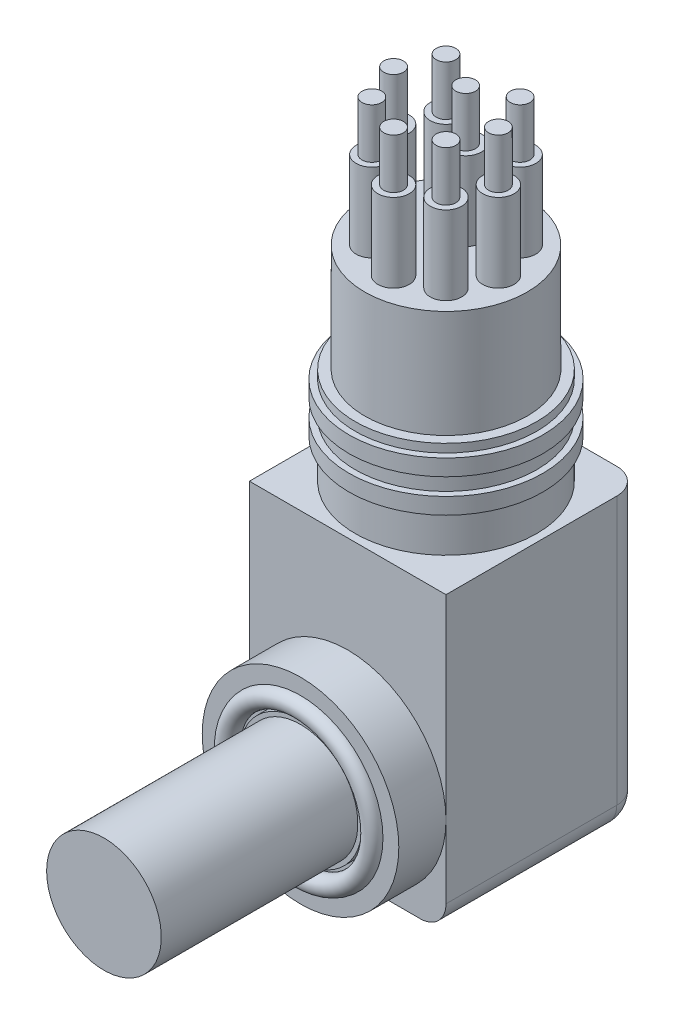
ISO-10303-21;
HEADER;
FILE_DESCRIPTION(('STEP AP214'),'2;1');
FILE_NAME('part.step','',(''),(''),'','','');
FILE_SCHEMA(('AUTOMOTIVE_DESIGN { 1 0 10303 214 1 1 1 1 }'));
ENDSEC;
DATA;
#1=APPLICATION_CONTEXT('core data for automotive mechanical design processes');
#2=APPLICATION_PROTOCOL_DEFINITION('international standard','automotive_design',2000,#1);
#3=PRODUCT_CONTEXT('',#1,'mechanical');
#4=PRODUCT('Part','Part','',(#3));
#5=PRODUCT_RELATED_PRODUCT_CATEGORY('part','',(#4));
#6=PRODUCT_DEFINITION_FORMATION('','',#4);
#7=PRODUCT_DEFINITION_CONTEXT('part definition',#1,'design');
#8=PRODUCT_DEFINITION('design','',#6,#7);
#9=PRODUCT_DEFINITION_SHAPE('','',#8);
#10=(LENGTH_UNIT() NAMED_UNIT(*) SI_UNIT(.MILLI.,.METRE.));
#11=(NAMED_UNIT(*) PLANE_ANGLE_UNIT() SI_UNIT($,.RADIAN.));
#12=(NAMED_UNIT(*) SI_UNIT($,.STERADIAN.) SOLID_ANGLE_UNIT());
#13=UNCERTAINTY_MEASURE_WITH_UNIT(LENGTH_MEASURE(1.E-05),#10,'distance_accuracy_value','');
#14=(GEOMETRIC_REPRESENTATION_CONTEXT(3) GLOBAL_UNCERTAINTY_ASSIGNED_CONTEXT((#13)) GLOBAL_UNIT_ASSIGNED_CONTEXT((#10,
#11,#12)) REPRESENTATION_CONTEXT('',''));
#15=CARTESIAN_POINT('',(0.,0.,0.));
#16=DIRECTION('',(0.,0.,1.));
#17=DIRECTION('',(1.,0.,0.));
#18=AXIS2_PLACEMENT_3D('',#15,#16,#17);
#19=CARTESIAN_POINT('',(0.,9.525,14.097));
#20=DIRECTION('',(0.,0.,1.));
#21=DIRECTION('',(1.,0.,0.));
#22=AXIS2_PLACEMENT_3D('',#19,#20,#21);
#23=PLANE('',#22);
#24=CARTESIAN_POINT('',(0.,9.525,14.097));
#25=DIRECTION('',(0.,0.,1.));
#26=DIRECTION('',(1.,0.,0.));
#27=AXIS2_PLACEMENT_3D('',#24,#25,#26);
#28=CIRCLE('',#27,9.525);
#29=CARTESIAN_POINT('',(9.525,9.525,14.097));
#30=VERTEX_POINT('',#29);
#31=EDGE_CURVE('E165',#30,#30,#28,.T.);
#32=ORIENTED_EDGE('',*,*,#31,.T.);
#33=EDGE_LOOP('',(#32));
#34=FACE_BOUND('',#33,.T.);
#35=CARTESIAN_POINT('',(0.,9.525,14.097));
#36=DIRECTION('',(0.,0.,1.));
#37=DIRECTION('',(1.,0.,0.));
#38=AXIS2_PLACEMENT_3D('',#35,#36,#37);
#39=CIRCLE('',#38,7.99);
#40=CARTESIAN_POINT('',(7.99,9.525,14.097));
#41=VERTEX_POINT('',#40);
#42=EDGE_CURVE('E427',#41,#41,#39,.F.);
#43=ORIENTED_EDGE('',*,*,#42,.T.);
#44=EDGE_LOOP('',(#43));
#45=FACE_BOUND('',#44,.T.);
#46=ADVANCED_FACE('F44',(#34,#45),#23,.T.);
#47=CARTESIAN_POINT('',(-9.525,28.448,9.525));
#48=DIRECTION('',(0.,0.,-1.));
#49=DIRECTION('',(-1.,0.,0.));
#50=AXIS2_PLACEMENT_3D('',#47,#48,#49);
#51=PLANE('',#50);
#52=CARTESIAN_POINT('',(0.,9.525,9.525));
#53=DIRECTION('',(0.,0.,1.));
#54=DIRECTION('',(1.,0.,0.));
#55=AXIS2_PLACEMENT_3D('',#52,#53,#54);
#56=CIRCLE('',#55,9.525);
#57=CARTESIAN_POINT('',(9.525,9.525,9.525));
#58=VERTEX_POINT('',#57);
#59=CARTESIAN_POINT('',(-9.525,9.525,9.525));
#60=VERTEX_POINT('',#59);
#61=EDGE_CURVE('E158',#58,#60,#56,.T.);
#62=ORIENTED_EDGE('',*,*,#61,.F.);
#63=DIRECTION('',(0.,-1.,0.));
#64=VECTOR('',#63,1.);
#65=CARTESIAN_POINT('',(9.525,28.448,9.525));
#66=LINE('',#65,#64);
#67=CARTESIAN_POINT('',(9.525,28.448,9.525));
#68=VERTEX_POINT('',#67);
#69=EDGE_CURVE('E132',#68,#58,#66,.T.);
#70=ORIENTED_EDGE('',*,*,#69,.F.);
#71=DIRECTION('',(1.,0.,0.));
#72=VECTOR('',#71,1.);
#73=CARTESIAN_POINT('',(-9.525,28.448,9.525));
#74=LINE('',#73,#72);
#75=CARTESIAN_POINT('',(-9.525,28.448,9.525));
#76=VERTEX_POINT('',#75);
#77=EDGE_CURVE('E357',#76,#68,#74,.T.);
#78=ORIENTED_EDGE('',*,*,#77,.F.);
#79=DIRECTION('',(0.,-1.,0.));
#80=VECTOR('',#79,1.);
#81=CARTESIAN_POINT('',(-9.525,28.448,9.525));
#82=LINE('',#81,#80);
#83=EDGE_CURVE('E161',#76,#60,#82,.T.);
#84=ORIENTED_EDGE('',*,*,#83,.T.);
#85=EDGE_LOOP('',(#62,#70,#78,#84));
#86=FACE_BOUND('',#85,.T.);
#87=ADVANCED_FACE('F159',(#86),#51,.F.);
#88=CARTESIAN_POINT('',(-9.525,2.5,9.525));
#89=VERTEX_POINT('',#88);
#90=EDGE_CURVE('E144',#60,#89,#82,.T.);
#91=ORIENTED_EDGE('',*,*,#90,.T.);
#92=CARTESIAN_POINT('',(-7.025,2.5,9.525));
#93=DIRECTION('',(0.,0.,-1.));
#94=DIRECTION('',(-1.,0.,0.));
#95=AXIS2_PLACEMENT_3D('',#92,#93,#94);
#96=CIRCLE('',#95,2.5);
#97=CARTESIAN_POINT('',(-7.025,0.,9.525));
#98=VERTEX_POINT('',#97);
#99=EDGE_CURVE('E403',#89,#98,#96,.F.);
#100=ORIENTED_EDGE('',*,*,#99,.T.);
#101=DIRECTION('',(1.,0.,0.));
#102=VECTOR('',#101,1.);
#103=CARTESIAN_POINT('',(-9.525,0.,9.525));
#104=LINE('',#103,#102);
#105=CARTESIAN_POINT('',(0.,0.,9.525));
#106=VERTEX_POINT('',#105);
#107=EDGE_CURVE('E358',#98,#106,#104,.T.);
#108=ORIENTED_EDGE('',*,*,#107,.T.);
#109=EDGE_CURVE('E168',#60,#106,#56,.T.);
#110=ORIENTED_EDGE('',*,*,#109,.F.);
#111=EDGE_LOOP('',(#91,#100,#108,#110));
#112=FACE_BOUND('',#111,.T.);
#113=ADVANCED_FACE('F481',(#112),#51,.F.);
#114=CARTESIAN_POINT('',(7.025,0.,9.525));
#115=VERTEX_POINT('',#114);
#116=EDGE_CURVE('E353',#106,#115,#104,.T.);
#117=ORIENTED_EDGE('',*,*,#116,.T.);
#118=CARTESIAN_POINT('',(7.025,2.5,9.525));
#119=DIRECTION('',(0.,0.,-1.));
#120=DIRECTION('',(-1.,0.,0.));
#121=AXIS2_PLACEMENT_3D('',#118,#119,#120);
#122=CIRCLE('',#121,2.5);
#123=CARTESIAN_POINT('',(9.525,2.5,9.525));
#124=VERTEX_POINT('',#123);
#125=EDGE_CURVE('E154',#115,#124,#122,.F.);
#126=ORIENTED_EDGE('',*,*,#125,.T.);
#127=EDGE_CURVE('E136',#58,#124,#66,.T.);
#128=ORIENTED_EDGE('',*,*,#127,.F.);
#129=EDGE_CURVE('E151',#106,#58,#56,.T.);
#130=ORIENTED_EDGE('',*,*,#129,.F.);
#131=EDGE_LOOP('',(#117,#126,#128,#130));
#132=FACE_BOUND('',#131,.T.);
#133=ADVANCED_FACE('F149',(#132),#51,.F.);
#134=CARTESIAN_POINT('',(0.,55.88,-1.905));
#135=DIRECTION('',(0.,1.,0.));
#136=DIRECTION('',(-1.,0.,0.));
#137=AXIS2_PLACEMENT_3D('',#134,#135,#136);
#138=PLANE('',#137);
#139=CARTESIAN_POINT('',(0.,55.88,-1.905));
#140=DIRECTION('',(0.,1.,0.));
#141=DIRECTION('',(-1.,0.,0.));
#142=AXIS2_PLACEMENT_3D('',#139,#140,#141);
#143=CIRCLE('',#142,1.524);
#144=CARTESIAN_POINT('',(-1.52400000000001,55.88,-1.905));
#145=VERTEX_POINT('',#144);
#146=EDGE_CURVE('E190',#145,#145,#143,.T.);
#147=ORIENTED_EDGE('',*,*,#146,.T.);
#148=EDGE_LOOP('',(#147));
#149=FACE_BOUND('',#148,.T.);
#150=CARTESIAN_POINT('',(0.,55.88,-1.905));
#151=DIRECTION('',(0.,1.,0.));
#152=DIRECTION('',(-1.,0.,0.));
#153=AXIS2_PLACEMENT_3D('',#150,#151,#152);
#154=CIRCLE('',#153,0.9525);
#155=CARTESIAN_POINT('',(-0.952500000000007,55.88,-1.905));
#156=VERTEX_POINT('',#155);
#157=EDGE_CURVE('E181',#156,#156,#154,.T.);
#158=ORIENTED_EDGE('',*,*,#157,.F.);
#159=EDGE_LOOP('',(#158));
#160=FACE_BOUND('',#159,.T.);
#161=ADVANCED_FACE('F639',(#149,#160),#138,.T.);
#162=CARTESIAN_POINT('',(0.,48.26,0.));
#163=DIRECTION('',(0.,1.,0.));
#164=DIRECTION('',(-1.,0.,0.));
#165=AXIS2_PLACEMENT_3D('',#162,#163,#164);
#166=PLANE('',#165);
#167=CARTESIAN_POINT('',(3.59210244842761,48.26,3.59210244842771));
#168=DIRECTION('',(0.,1.,0.));
#169=DIRECTION('',(-0.707106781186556,0.,0.707106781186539));
#170=AXIS2_PLACEMENT_3D('',#167,#168,#169);
#171=CIRCLE('',#170,1.524);
#172=CARTESIAN_POINT('',(2.5144717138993,48.26,4.66973318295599));
#173=VERTEX_POINT('',#172);
#174=EDGE_CURVE('E194',#173,#173,#171,.T.);
#175=ORIENTED_EDGE('',*,*,#174,.F.);
#176=EDGE_LOOP('',(#175));
#177=FACE_BOUND('',#176,.T.);
#178=CARTESIAN_POINT('',(3.59210244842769,48.26,-3.59210244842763));
#179=DIRECTION('',(0.,1.,0.));
#180=DIRECTION('',(0.707106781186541,0.,0.707106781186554));
#181=AXIS2_PLACEMENT_3D('',#178,#179,#180);
#182=CIRCLE('',#181,1.524);
#183=CARTESIAN_POINT('',(4.66973318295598,48.26,-2.51447171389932));
#184=VERTEX_POINT('',#183);
#185=EDGE_CURVE('E229',#184,#184,#182,.T.);
#186=ORIENTED_EDGE('',*,*,#185,.F.);
#187=EDGE_LOOP('',(#186));
#188=FACE_BOUND('',#187,.T.);
#189=CARTESIAN_POINT('',(-5.08000000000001,48.26,0.));
#190=DIRECTION('',(0.,1.,0.));
#191=DIRECTION('',(0.,0.,-1.));
#192=AXIS2_PLACEMENT_3D('',#189,#190,#191);
#193=CIRCLE('',#192,1.524);
#194=CARTESIAN_POINT('',(-5.08,48.26,-1.52400000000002));
#195=VERTEX_POINT('',#194);
#196=EDGE_CURVE('E261',#195,#195,#193,.T.);
#197=ORIENTED_EDGE('',*,*,#196,.F.);
#198=EDGE_LOOP('',(#197));
#199=FACE_BOUND('',#198,.T.);
#200=CARTESIAN_POINT('',(0.,48.26,5.08));
#201=DIRECTION('',(0.,1.,0.));
#202=DIRECTION('',(-1.,0.,0.));
#203=AXIS2_PLACEMENT_3D('',#200,#201,#202);
#204=CIRCLE('',#203,1.524);
#205=CARTESIAN_POINT('',(-1.52400000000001,48.26,5.08));
#206=VERTEX_POINT('',#205);
#207=EDGE_CURVE('E298',#206,#206,#204,.T.);
#208=ORIENTED_EDGE('',*,*,#207,.F.);
#209=EDGE_LOOP('',(#208));
#210=FACE_BOUND('',#209,.T.);
#211=CARTESIAN_POINT('',(0.,48.26,0.));
#212=DIRECTION('',(0.,1.,0.));
#213=DIRECTION('',(-1.,0.,0.));
#214=AXIS2_PLACEMENT_3D('',#211,#212,#213);
#215=CIRCLE('',#214,7.874);
#216=CARTESIAN_POINT('',(-7.874,48.26,0.));
#217=VERTEX_POINT('',#216);
#218=EDGE_CURVE('E306',#217,#217,#215,.T.);
#219=ORIENTED_EDGE('',*,*,#218,.T.);
#220=EDGE_LOOP('',(#219));
#221=FACE_BOUND('',#220,.T.);
#222=CARTESIAN_POINT('',(-3.59210244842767,48.26,3.59210244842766));
#223=DIRECTION('',(0.,1.,0.));
#224=DIRECTION('',(-0.707106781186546,0.,-0.707106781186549));
#225=AXIS2_PLACEMENT_3D('',#222,#223,#224);
#226=CIRCLE('',#225,1.524);
#227=CARTESIAN_POINT('',(-4.66973318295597,48.26,2.51447171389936));
#228=VERTEX_POINT('',#227);
#229=EDGE_CURVE('E277',#228,#228,#226,.T.);
#230=ORIENTED_EDGE('',*,*,#229,.F.);
#231=EDGE_LOOP('',(#230));
#232=FACE_BOUND('',#231,.T.);
#233=CARTESIAN_POINT('',(-3.59210244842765,48.26,-3.59210244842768));
#234=DIRECTION('',(0.,1.,0.));
#235=DIRECTION('',(0.707106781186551,0.,-0.707106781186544));
#236=AXIS2_PLACEMENT_3D('',#233,#234,#235);
#237=CIRCLE('',#236,1.524);
#238=CARTESIAN_POINT('',(-2.51447171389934,48.26,-4.66973318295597));
#239=VERTEX_POINT('',#238);
#240=EDGE_CURVE('E245',#239,#239,#237,.T.);
#241=ORIENTED_EDGE('',*,*,#240,.F.);
#242=EDGE_LOOP('',(#241));
#243=FACE_BOUND('',#242,.T.);
#244=CARTESIAN_POINT('',(5.07999999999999,48.26,0.));
#245=DIRECTION('',(0.,1.,0.));
#246=DIRECTION('',(0.,0.,1.));
#247=AXIS2_PLACEMENT_3D('',#244,#245,#246);
#248=CIRCLE('',#247,1.524);
#249=CARTESIAN_POINT('',(5.07999999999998,48.26,1.52400000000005));
#250=VERTEX_POINT('',#249);
#251=EDGE_CURVE('E213',#250,#250,#248,.T.);
#252=ORIENTED_EDGE('',*,*,#251,.F.);
#253=EDGE_LOOP('',(#252));
#254=FACE_BOUND('',#253,.T.);
#255=CARTESIAN_POINT('',(0.,48.26,-1.905));
#256=DIRECTION('',(0.,1.,0.));
#257=DIRECTION('',(-1.,0.,0.));
#258=AXIS2_PLACEMENT_3D('',#255,#256,#257);
#259=CIRCLE('',#258,1.524);
#260=CARTESIAN_POINT('',(-1.52400000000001,48.26,-1.905));
#261=VERTEX_POINT('',#260);
#262=EDGE_CURVE('E189',#261,#261,#259,.T.);
#263=ORIENTED_EDGE('',*,*,#262,.F.);
#264=EDGE_LOOP('',(#263));
#265=FACE_BOUND('',#264,.T.);
#266=ADVANCED_FACE('F665',(#177,#188,#199,#210,#221,#232,#243,#254,#265),#166,.T.);
#267=CARTESIAN_POINT('',(0.,55.88,5.08));
#268=DIRECTION('',(0.,1.,0.));
#269=DIRECTION('',(-1.,0.,0.));
#270=AXIS2_PLACEMENT_3D('',#267,#268,#269);
#271=PLANE('',#270);
#272=CARTESIAN_POINT('',(0.,55.88,5.08));
#273=DIRECTION('',(0.,1.,0.));
#274=DIRECTION('',(-1.,0.,0.));
#275=AXIS2_PLACEMENT_3D('',#272,#273,#274);
#276=CIRCLE('',#275,1.524);
#277=CARTESIAN_POINT('',(-1.52400000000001,55.88,5.08));
#278=VERTEX_POINT('',#277);
#279=EDGE_CURVE('E302',#278,#278,#276,.T.);
#280=ORIENTED_EDGE('',*,*,#279,.T.);
#281=EDGE_LOOP('',(#280));
#282=FACE_BOUND('',#281,.T.);
#283=CARTESIAN_POINT('',(0.,55.88,5.08));
#284=DIRECTION('',(0.,1.,0.));
#285=DIRECTION('',(-1.,0.,0.));
#286=AXIS2_PLACEMENT_3D('',#283,#284,#285);
#287=CIRCLE('',#286,0.9525);
#288=CARTESIAN_POINT('',(-0.952500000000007,55.88,5.08));
#289=VERTEX_POINT('',#288);
#290=EDGE_CURVE('E293',#289,#289,#287,.T.);
#291=ORIENTED_EDGE('',*,*,#290,.F.);
#292=EDGE_LOOP('',(#291));
#293=FACE_BOUND('',#292,.T.);
#294=ADVANCED_FACE('F684',(#282,#293),#271,.T.);
#295=CARTESIAN_POINT('',(8.8011,37.846,0.));
#296=DIRECTION('',(0.,-1.,0.));
#297=DIRECTION('',(1.,0.,0.));
#298=AXIS2_PLACEMENT_3D('',#295,#296,#297);
#299=PLANE('',#298);
#300=CARTESIAN_POINT('',(0.,37.846,0.));
#301=DIRECTION('',(0.,1.,0.));
#302=DIRECTION('',(-1.,0.,0.));
#303=AXIS2_PLACEMENT_3D('',#300,#301,#302);
#304=CIRCLE('',#303,8.8011);
#305=CARTESIAN_POINT('',(-8.80110000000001,37.846,0.));
#306=VERTEX_POINT('',#305);
#307=EDGE_CURVE('E349',#306,#306,#304,.T.);
#308=ORIENTED_EDGE('',*,*,#307,.T.);
#309=EDGE_LOOP('',(#308));
#310=FACE_BOUND('',#309,.T.);
#311=CARTESIAN_POINT('',(0.,37.846,0.));
#312=DIRECTION('',(0.,-1.,0.));
#313=DIRECTION('',(1.,0.,0.));
#314=AXIS2_PLACEMENT_3D('',#311,#312,#313);
#315=CIRCLE('',#314,7.874);
#316=CARTESIAN_POINT('',(7.87399999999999,37.846,0.));
#317=VERTEX_POINT('',#316);
#318=EDGE_CURVE('E171',#317,#317,#315,.F.);
#319=ORIENTED_EDGE('',*,*,#318,.F.);
#320=EDGE_LOOP('',(#319));
#321=FACE_BOUND('',#320,.T.);
#322=ADVANCED_FACE('F952',(#310,#321),#299,.F.);
#323=CARTESIAN_POINT('',(-9.525,28.448,-9.525));
#324=DIRECTION('',(0.,1.,0.));
#325=DIRECTION('',(0.,0.,1.));
#326=AXIS2_PLACEMENT_3D('',#323,#324,#325);
#327=PLANE('',#326);
#328=DIRECTION('',(-1.,0.,0.));
#329=VECTOR('',#328,1.);
#330=CARTESIAN_POINT('',(-9.525,28.448,-9.525));
#331=LINE('',#330,#329);
#332=CARTESIAN_POINT('',(7.02499999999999,28.448,-9.525));
#333=VERTEX_POINT('',#332);
#334=CARTESIAN_POINT('',(-7.025,28.448,-9.525));
#335=VERTEX_POINT('',#334);
#336=EDGE_CURVE('E155',#333,#335,#331,.T.);
#337=ORIENTED_EDGE('',*,*,#336,.T.);
#338=CARTESIAN_POINT('',(-7.025,28.448,-7.025));
#339=DIRECTION('',(0.,1.,0.));
#340=DIRECTION('',(0.,0.,1.));
#341=AXIS2_PLACEMENT_3D('',#338,#339,#340);
#342=CIRCLE('',#341,2.5);
#343=CARTESIAN_POINT('',(-9.525,28.448,-7.025));
#344=VERTEX_POINT('',#343);
#345=EDGE_CURVE('E11',#335,#344,#342,.T.);
#346=ORIENTED_EDGE('',*,*,#345,.T.);
#347=DIRECTION('',(0.,0.,1.));
#348=VECTOR('',#347,1.);
#349=CARTESIAN_POINT('',(-9.525,28.448,-9.525));
#350=LINE('',#349,#348);
#351=EDGE_CURVE('E354',#344,#76,#350,.T.);
#352=ORIENTED_EDGE('',*,*,#351,.T.);
#353=ORIENTED_EDGE('',*,*,#77,.T.);
#354=DIRECTION('',(0.,0.,-1.));
#355=VECTOR('',#354,1.);
#356=CARTESIAN_POINT('',(9.525,28.448,-9.525));
#357=LINE('',#356,#355);
#358=CARTESIAN_POINT('',(9.525,28.448,-7.025));
#359=VERTEX_POINT('',#358);
#360=EDGE_CURVE('E139',#68,#359,#357,.T.);
#361=ORIENTED_EDGE('',*,*,#360,.T.);
#362=CARTESIAN_POINT('',(7.025,28.448,-7.025));
#363=DIRECTION('',(0.,1.,0.));
#364=DIRECTION('',(0.,0.,1.));
#365=AXIS2_PLACEMENT_3D('',#362,#363,#364);
#366=CIRCLE('',#365,2.5);
#367=EDGE_CURVE('E54',#359,#333,#366,.T.);
#368=ORIENTED_EDGE('',*,*,#367,.T.);
#369=EDGE_LOOP('',(#337,#346,#352,#353,#361,#368));
#370=FACE_BOUND('',#369,.T.);
#371=CARTESIAN_POINT('',(0.,28.448,0.));
#372=DIRECTION('',(0.,1.,0.));
#373=DIRECTION('',(-1.,0.,0.));
#374=AXIS2_PLACEMENT_3D('',#371,#372,#373);
#375=CIRCLE('',#374,8.8011);
#376=CARTESIAN_POINT('',(-8.80110000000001,28.448,0.));
#377=VERTEX_POINT('',#376);
#378=EDGE_CURVE('E313',#377,#377,#375,.T.);
#379=ORIENTED_EDGE('',*,*,#378,.F.);
#380=EDGE_LOOP('',(#379));
#381=FACE_BOUND('',#380,.T.);
#382=ADVANCED_FACE('F981',(#370,#381),#327,.T.);
#383=CARTESIAN_POINT('',(-9.525,28.448,-9.525));
#384=DIRECTION('',(1.,0.,0.));
#385=DIRECTION('',(0.,0.,-1.));
#386=AXIS2_PLACEMENT_3D('',#383,#384,#385);
#387=PLANE('',#386);
#388=DIRECTION('',(0.,-1.,0.));
#389=VECTOR('',#388,1.);
#390=CARTESIAN_POINT('',(-9.525,28.448,-7.025));
#391=LINE('',#390,#389);
#392=CARTESIAN_POINT('',(-9.525,2.5,-7.025));
#393=VERTEX_POINT('',#392);
#394=EDGE_CURVE('E62',#344,#393,#391,.T.);
#395=ORIENTED_EDGE('',*,*,#394,.T.);
#396=DIRECTION('',(0.,0.,1.));
#397=VECTOR('',#396,1.);
#398=CARTESIAN_POINT('',(-9.525,2.5,-9.525));
#399=LINE('',#398,#397);
#400=EDGE_CURVE('E401',#393,#89,#399,.T.);
#401=ORIENTED_EDGE('',*,*,#400,.T.);
#402=ORIENTED_EDGE('',*,*,#90,.F.);
#403=ORIENTED_EDGE('',*,*,#83,.F.);
#404=ORIENTED_EDGE('',*,*,#351,.F.);
#405=EDGE_LOOP('',(#395,#401,#402,#403,#404));
#406=FACE_BOUND('',#405,.T.);
#407=ADVANCED_FACE('F1077',(#406),#387,.F.);
#408=CARTESIAN_POINT('',(9.525,28.448,-9.525));
#409=DIRECTION('',(-1.,0.,0.));
#410=DIRECTION('',(0.,0.,1.));
#411=AXIS2_PLACEMENT_3D('',#408,#409,#410);
#412=PLANE('',#411);
#413=ORIENTED_EDGE('',*,*,#127,.T.);
#414=DIRECTION('',(0.,0.,-1.));
#415=VECTOR('',#414,1.);
#416=CARTESIAN_POINT('',(9.525,2.5,-9.525));
#417=LINE('',#416,#415);
#418=CARTESIAN_POINT('',(9.525,2.5,-7.025));
#419=VERTEX_POINT('',#418);
#420=EDGE_CURVE('E379',#124,#419,#417,.T.);
#421=ORIENTED_EDGE('',*,*,#420,.T.);
#422=DIRECTION('',(0.,-1.,0.));
#423=VECTOR('',#422,1.);
#424=CARTESIAN_POINT('',(9.525,28.448,-7.025));
#425=LINE('',#424,#423);
#426=EDGE_CURVE('E376',#419,#359,#425,.F.);
#427=ORIENTED_EDGE('',*,*,#426,.T.);
#428=ORIENTED_EDGE('',*,*,#360,.F.);
#429=ORIENTED_EDGE('',*,*,#69,.T.);
#430=EDGE_LOOP('',(#413,#421,#427,#428,#429));
#431=FACE_BOUND('',#430,.T.);
#432=ADVANCED_FACE('F134',(#431),#412,.F.);
#433=CARTESIAN_POINT('',(-9.525,28.448,-9.525));
#434=DIRECTION('',(0.,0.,1.));
#435=DIRECTION('',(1.,0.,0.));
#436=AXIS2_PLACEMENT_3D('',#433,#434,#435);
#437=PLANE('',#436);
#438=DIRECTION('',(-1.,0.,0.));
#439=VECTOR('',#438,1.);
#440=CARTESIAN_POINT('',(-9.525,2.5,-9.525));
#441=LINE('',#440,#439);
#442=CARTESIAN_POINT('',(7.025,2.5,-9.525));
#443=VERTEX_POINT('',#442);
#444=CARTESIAN_POINT('',(-7.025,2.5,-9.525));
#445=VERTEX_POINT('',#444);
#446=EDGE_CURVE('E393',#443,#445,#441,.T.);
#447=ORIENTED_EDGE('',*,*,#446,.T.);
#448=DIRECTION('',(0.,-1.,0.));
#449=VECTOR('',#448,1.);
#450=CARTESIAN_POINT('',(-7.025,28.448,-9.525));
#451=LINE('',#450,#449);
#452=EDGE_CURVE('E396',#445,#335,#451,.F.);
#453=ORIENTED_EDGE('',*,*,#452,.T.);
#454=ORIENTED_EDGE('',*,*,#336,.F.);
#455=DIRECTION('',(0.,-1.,0.));
#456=VECTOR('',#455,1.);
#457=CARTESIAN_POINT('',(7.025,28.448,-9.525));
#458=LINE('',#457,#456);
#459=EDGE_CURVE('E390',#333,#443,#458,.T.);
#460=ORIENTED_EDGE('',*,*,#459,.T.);
#461=EDGE_LOOP('',(#447,#453,#454,#460));
#462=FACE_BOUND('',#461,.T.);
#463=ADVANCED_FACE('F1085',(#462),#437,.F.);
#464=CARTESIAN_POINT('',(-9.525,0.,-9.525));
#465=DIRECTION('',(0.,1.,0.));
#466=DIRECTION('',(0.,0.,1.));
#467=AXIS2_PLACEMENT_3D('',#464,#465,#466);
#468=PLANE('',#467);
#469=DIRECTION('',(-1.,0.,0.));
#470=VECTOR('',#469,1.);
#471=CARTESIAN_POINT('',(-9.525,0.,-7.025));
#472=LINE('',#471,#470);
#473=CARTESIAN_POINT('',(-7.025,0.,-7.025));
#474=VERTEX_POINT('',#473);
#475=CARTESIAN_POINT('',(7.025,0.,-7.025));
#476=VERTEX_POINT('',#475);
#477=EDGE_CURVE('E385',#474,#476,#472,.F.);
#478=ORIENTED_EDGE('',*,*,#477,.T.);
#479=DIRECTION('',(0.,0.,-1.));
#480=VECTOR('',#479,1.);
#481=CARTESIAN_POINT('',(7.025,0.,-9.52500000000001));
#482=LINE('',#481,#480);
#483=EDGE_CURVE('E387',#476,#115,#482,.F.);
#484=ORIENTED_EDGE('',*,*,#483,.T.);
#485=ORIENTED_EDGE('',*,*,#116,.F.);
#486=ORIENTED_EDGE('',*,*,#107,.F.);
#487=DIRECTION('',(0.,0.,1.));
#488=VECTOR('',#487,1.);
#489=CARTESIAN_POINT('',(-7.025,0.,-9.525));
#490=LINE('',#489,#488);
#491=EDGE_CURVE('E382',#98,#474,#490,.F.);
#492=ORIENTED_EDGE('',*,*,#491,.T.);
#493=EDGE_LOOP('',(#478,#484,#485,#486,#492));
#494=FACE_BOUND('',#493,.T.);
#495=ADVANCED_FACE('F1068',(#494),#468,.F.);
#496=CARTESIAN_POINT('',(0.,0.,0.));
#497=DIRECTION('',(0.,1.,0.));
#498=DIRECTION('',(-1.,0.,0.));
#499=AXIS2_PLACEMENT_3D('',#496,#497,#498);
#500=CYLINDRICAL_SURFACE('',#499,8.8011);
#501=ORIENTED_EDGE('',*,*,#307,.F.);
#502=EDGE_LOOP('',(#501));
#503=FACE_BOUND('',#502,.T.);
#504=CARTESIAN_POINT('',(0.,37.0332,0.));
#505=DIRECTION('',(0.,1.,0.));
#506=DIRECTION('',(-1.,0.,0.));
#507=AXIS2_PLACEMENT_3D('',#504,#505,#506);
#508=CIRCLE('',#507,8.8011);
#509=CARTESIAN_POINT('',(-8.80110000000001,37.0332,0.));
#510=VERTEX_POINT('',#509);
#511=EDGE_CURVE('E345',#510,#510,#508,.T.);
#512=ORIENTED_EDGE('',*,*,#511,.T.);
#513=EDGE_LOOP('',(#512));
#514=FACE_BOUND('',#513,.T.);
#515=ADVANCED_FACE('F1059',(#503,#514),#500,.T.);
#516=CARTESIAN_POINT('',(9.398,37.0332,0.));
#517=DIRECTION('',(0.,-1.,0.));
#518=DIRECTION('',(1.,0.,0.));
#519=AXIS2_PLACEMENT_3D('',#516,#517,#518);
#520=PLANE('',#519);
#521=ORIENTED_EDGE('',*,*,#511,.F.);
#522=EDGE_LOOP('',(#521));
#523=FACE_BOUND('',#522,.T.);
#524=CARTESIAN_POINT('',(0.,37.0332,0.));
#525=DIRECTION('',(0.,1.,0.));
#526=DIRECTION('',(-1.,0.,0.));
#527=AXIS2_PLACEMENT_3D('',#524,#525,#526);
#528=CIRCLE('',#527,9.398);
#529=CARTESIAN_POINT('',(-9.39800000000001,37.0332,0.));
#530=VERTEX_POINT('',#529);
#531=EDGE_CURVE('E341',#530,#530,#528,.T.);
#532=ORIENTED_EDGE('',*,*,#531,.T.);
#533=EDGE_LOOP('',(#532));
#534=FACE_BOUND('',#533,.T.);
#535=ADVANCED_FACE('F1049',(#523,#534),#520,.F.);
#536=CARTESIAN_POINT('',(0.,0.,0.));
#537=DIRECTION('',(0.,1.,0.));
#538=DIRECTION('',(-1.,0.,0.));
#539=AXIS2_PLACEMENT_3D('',#536,#537,#538);
#540=CYLINDRICAL_SURFACE('',#539,9.398);
#541=ORIENTED_EDGE('',*,*,#531,.F.);
#542=EDGE_LOOP('',(#541));
#543=FACE_BOUND('',#542,.T.);
#544=CARTESIAN_POINT('',(0.,35.4584000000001,0.));
#545=DIRECTION('',(0.,1.,0.));
#546=DIRECTION('',(-1.,0.,0.));
#547=AXIS2_PLACEMENT_3D('',#544,#545,#546);
#548=CIRCLE('',#547,9.398);
#549=CARTESIAN_POINT('',(-9.39800000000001,35.4584000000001,0.));
#550=VERTEX_POINT('',#549);
#551=EDGE_CURVE('E337',#550,#550,#548,.T.);
#552=ORIENTED_EDGE('',*,*,#551,.T.);
#553=EDGE_LOOP('',(#552));
#554=FACE_BOUND('',#553,.T.);
#555=ADVANCED_FACE('F1040',(#543,#554),#540,.T.);
#556=CARTESIAN_POINT('',(8.8011,35.4584000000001,0.));
#557=DIRECTION('',(0.,1.,0.));
#558=DIRECTION('',(-1.,0.,0.));
#559=AXIS2_PLACEMENT_3D('',#556,#557,#558);
#560=PLANE('',#559);
#561=ORIENTED_EDGE('',*,*,#551,.F.);
#562=EDGE_LOOP('',(#561));
#563=FACE_BOUND('',#562,.T.);
#564=CARTESIAN_POINT('',(0.,35.4584000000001,0.));
#565=DIRECTION('',(0.,1.,0.));
#566=DIRECTION('',(-1.,0.,0.));
#567=AXIS2_PLACEMENT_3D('',#564,#565,#566);
#568=CIRCLE('',#567,8.8011);
#569=CARTESIAN_POINT('',(-8.80110000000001,35.4584000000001,0.));
#570=VERTEX_POINT('',#569);
#571=EDGE_CURVE('E333',#570,#570,#568,.T.);
#572=ORIENTED_EDGE('',*,*,#571,.T.);
#573=EDGE_LOOP('',(#572));
#574=FACE_BOUND('',#573,.T.);
#575=ADVANCED_FACE('F1030',(#563,#574),#560,.F.);
#576=CARTESIAN_POINT('',(0.,0.,0.));
#577=DIRECTION('',(0.,1.,0.));
#578=DIRECTION('',(-1.,0.,0.));
#579=AXIS2_PLACEMENT_3D('',#576,#577,#578);
#580=CYLINDRICAL_SURFACE('',#579,8.8011);
#581=ORIENTED_EDGE('',*,*,#571,.F.);
#582=EDGE_LOOP('',(#581));
#583=FACE_BOUND('',#582,.T.);
#584=CARTESIAN_POINT('',(0.,33.8074000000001,0.));
#585=DIRECTION('',(0.,1.,0.));
#586=DIRECTION('',(-1.,0.,0.));
#587=AXIS2_PLACEMENT_3D('',#584,#585,#586);
#588=CIRCLE('',#587,8.8011);
#589=CARTESIAN_POINT('',(-8.8011,33.8074000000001,0.));
#590=VERTEX_POINT('',#589);
#591=EDGE_CURVE('E329',#590,#590,#588,.T.);
#592=ORIENTED_EDGE('',*,*,#591,.T.);
#593=EDGE_LOOP('',(#592));
#594=FACE_BOUND('',#593,.T.);
#595=ADVANCED_FACE('F1020',(#583,#594),#580,.T.);
#596=CARTESIAN_POINT('',(9.398,33.8074000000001,0.));
#597=DIRECTION('',(0.,-1.,0.));
#598=DIRECTION('',(1.,0.,0.));
#599=AXIS2_PLACEMENT_3D('',#596,#597,#598);
#600=PLANE('',#599);
#601=ORIENTED_EDGE('',*,*,#591,.F.);
#602=EDGE_LOOP('',(#601));
#603=FACE_BOUND('',#602,.T.);
#604=CARTESIAN_POINT('',(0.,33.8074000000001,0.));
#605=DIRECTION('',(0.,1.,0.));
#606=DIRECTION('',(-1.,0.,0.));
#607=AXIS2_PLACEMENT_3D('',#604,#605,#606);
#608=CIRCLE('',#607,9.398);
#609=CARTESIAN_POINT('',(-9.398,33.8074000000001,0.));
#610=VERTEX_POINT('',#609);
#611=EDGE_CURVE('E325',#610,#610,#608,.T.);
#612=ORIENTED_EDGE('',*,*,#611,.T.);
#613=EDGE_LOOP('',(#612));
#614=FACE_BOUND('',#613,.T.);
#615=ADVANCED_FACE('F1010',(#603,#614),#600,.F.);
#616=CARTESIAN_POINT('',(0.,0.,0.));
#617=DIRECTION('',(0.,1.,0.));
#618=DIRECTION('',(-1.,0.,0.));
#619=AXIS2_PLACEMENT_3D('',#616,#617,#618);
#620=CYLINDRICAL_SURFACE('',#619,9.398);
#621=ORIENTED_EDGE('',*,*,#611,.F.);
#622=EDGE_LOOP('',(#621));
#623=FACE_BOUND('',#622,.T.);
#624=CARTESIAN_POINT('',(0.,32.2326000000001,0.));
#625=DIRECTION('',(0.,1.,0.));
#626=DIRECTION('',(-1.,0.,0.));
#627=AXIS2_PLACEMENT_3D('',#624,#625,#626);
#628=CIRCLE('',#627,9.398);
#629=CARTESIAN_POINT('',(-9.398,32.2326000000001,0.));
#630=VERTEX_POINT('',#629);
#631=EDGE_CURVE('E321',#630,#630,#628,.T.);
#632=ORIENTED_EDGE('',*,*,#631,.T.);
#633=EDGE_LOOP('',(#632));
#634=FACE_BOUND('',#633,.T.);
#635=ADVANCED_FACE('F1000',(#623,#634),#620,.T.);
#636=CARTESIAN_POINT('',(8.8011,32.2326000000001,0.));
#637=DIRECTION('',(0.,1.,0.));
#638=DIRECTION('',(-1.,0.,0.));
#639=AXIS2_PLACEMENT_3D('',#636,#637,#638);
#640=PLANE('',#639);
#641=ORIENTED_EDGE('',*,*,#631,.F.);
#642=EDGE_LOOP('',(#641));
#643=FACE_BOUND('',#642,.T.);
#644=CARTESIAN_POINT('',(0.,32.2326000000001,0.));
#645=DIRECTION('',(0.,1.,0.));
#646=DIRECTION('',(-1.,0.,0.));
#647=AXIS2_PLACEMENT_3D('',#644,#645,#646);
#648=CIRCLE('',#647,8.8011);
#649=CARTESIAN_POINT('',(-8.80110000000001,32.2326000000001,0.));
#650=VERTEX_POINT('',#649);
#651=EDGE_CURVE('E317',#650,#650,#648,.T.);
#652=ORIENTED_EDGE('',*,*,#651,.T.);
#653=EDGE_LOOP('',(#652));
#654=FACE_BOUND('',#653,.T.);
#655=ADVANCED_FACE('F990',(#643,#654),#640,.F.);
#656=CARTESIAN_POINT('',(0.,0.,0.));
#657=DIRECTION('',(0.,1.,0.));
#658=DIRECTION('',(-1.,0.,0.));
#659=AXIS2_PLACEMENT_3D('',#656,#657,#658);
#660=CYLINDRICAL_SURFACE('',#659,8.8011);
#661=ORIENTED_EDGE('',*,*,#651,.F.);
#662=EDGE_LOOP('',(#661));
#663=FACE_BOUND('',#662,.T.);
#664=ORIENTED_EDGE('',*,*,#378,.T.);
#665=EDGE_LOOP('',(#664));
#666=FACE_BOUND('',#665,.T.);
#667=ADVANCED_FACE('F971',(#663,#666),#660,.T.);
#668=CARTESIAN_POINT('',(0.,48.26,0.));
#669=DIRECTION('',(0.,-1.,0.));
#670=DIRECTION('',(1.,0.,0.));
#671=AXIS2_PLACEMENT_3D('',#668,#669,#670);
#672=CYLINDRICAL_SURFACE('',#671,7.874);
#673=ORIENTED_EDGE('',*,*,#218,.F.);
#674=EDGE_LOOP('',(#673));
#675=FACE_BOUND('',#674,.T.);
#676=ORIENTED_EDGE('',*,*,#318,.T.);
#677=EDGE_LOOP('',(#676));
#678=FACE_BOUND('',#677,.T.);
#679=ADVANCED_FACE('F961',(#675,#678),#672,.T.);
#680=CARTESIAN_POINT('',(0.,55.88,5.08));
#681=DIRECTION('',(0.,-1.,0.));
#682=DIRECTION('',(1.,0.,0.));
#683=AXIS2_PLACEMENT_3D('',#680,#681,#682);
#684=CYLINDRICAL_SURFACE('',#683,1.524);
#685=ORIENTED_EDGE('',*,*,#279,.F.);
#686=EDGE_LOOP('',(#685));
#687=FACE_BOUND('',#686,.T.);
#688=ORIENTED_EDGE('',*,*,#207,.T.);
#689=EDGE_LOOP('',(#688));
#690=FACE_BOUND('',#689,.T.);
#691=ADVANCED_FACE('F943',(#687,#690),#684,.T.);
#692=CARTESIAN_POINT('',(0.,60.706,5.08));
#693=DIRECTION('',(0.,-1.,0.));
#694=DIRECTION('',(1.,0.,0.));
#695=AXIS2_PLACEMENT_3D('',#692,#693,#694);
#696=CYLINDRICAL_SURFACE('',#695,0.9525);
#697=CARTESIAN_POINT('',(0.,60.706,5.08));
#698=DIRECTION('',(0.,1.,0.));
#699=DIRECTION('',(-1.,0.,0.));
#700=AXIS2_PLACEMENT_3D('',#697,#698,#699);
#701=CIRCLE('',#700,0.9525);
#702=CARTESIAN_POINT('',(-0.952500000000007,60.706,5.08));
#703=VERTEX_POINT('',#702);
#704=EDGE_CURVE('E294',#703,#703,#701,.T.);
#705=ORIENTED_EDGE('',*,*,#704,.F.);
#706=EDGE_LOOP('',(#705));
#707=FACE_BOUND('',#706,.T.);
#708=ORIENTED_EDGE('',*,*,#290,.T.);
#709=EDGE_LOOP('',(#708));
#710=FACE_BOUND('',#709,.T.);
#711=ADVANCED_FACE('F934',(#707,#710),#696,.T.);
#712=CARTESIAN_POINT('',(0.,60.706,5.08));
#713=DIRECTION('',(0.,1.,0.));
#714=DIRECTION('',(-1.,0.,0.));
#715=AXIS2_PLACEMENT_3D('',#712,#713,#714);
#716=PLANE('',#715);
#717=ORIENTED_EDGE('',*,*,#704,.T.);
#718=EDGE_LOOP('',(#717));
#719=FACE_BOUND('',#718,.T.);
#720=ADVANCED_FACE('F924',(#719),#716,.T.);
#721=CARTESIAN_POINT('',(-3.59210244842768,55.88,3.59210244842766));
#722=DIRECTION('',(0.,-1.,0.));
#723=DIRECTION('',(0.707106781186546,0.,0.707106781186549));
#724=AXIS2_PLACEMENT_3D('',#721,#722,#723);
#725=CYLINDRICAL_SURFACE('',#724,1.524);
#726=CARTESIAN_POINT('',(-3.59210244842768,55.88,3.59210244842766));
#727=DIRECTION('',(0.,1.,0.));
#728=DIRECTION('',(-0.707106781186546,0.,-0.707106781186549));
#729=AXIS2_PLACEMENT_3D('',#726,#727,#728);
#730=CIRCLE('',#729,1.524);
#731=CARTESIAN_POINT('',(-4.66973318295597,55.88,2.51447171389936));
#732=VERTEX_POINT('',#731);
#733=EDGE_CURVE('E289',#732,#732,#730,.T.);
#734=ORIENTED_EDGE('',*,*,#733,.F.);
#735=EDGE_LOOP('',(#734));
#736=FACE_BOUND('',#735,.T.);
#737=ORIENTED_EDGE('',*,*,#229,.T.);
#738=EDGE_LOOP('',(#737));
#739=FACE_BOUND('',#738,.T.);
#740=ADVANCED_FACE('F914',(#736,#739),#725,.T.);
#741=CARTESIAN_POINT('',(-3.59210244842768,55.88,3.59210244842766));
#742=DIRECTION('',(0.,1.,0.));
#743=DIRECTION('',(-0.707106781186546,0.,-0.707106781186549));
#744=AXIS2_PLACEMENT_3D('',#741,#742,#743);
#745=PLANE('',#744);
#746=ORIENTED_EDGE('',*,*,#733,.T.);
#747=EDGE_LOOP('',(#746));
#748=FACE_BOUND('',#747,.T.);
#749=CARTESIAN_POINT('',(-3.59210244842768,55.88,3.59210244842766));
#750=DIRECTION('',(0.,1.,0.));
#751=DIRECTION('',(-0.707106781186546,0.,-0.707106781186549));
#752=AXIS2_PLACEMENT_3D('',#749,#750,#751);
#753=CIRCLE('',#752,0.9525);
#754=CARTESIAN_POINT('',(-4.26562165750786,55.88,2.91858323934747));
#755=VERTEX_POINT('',#754);
#756=EDGE_CURVE('E285',#755,#755,#753,.T.);
#757=ORIENTED_EDGE('',*,*,#756,.F.);
#758=EDGE_LOOP('',(#757));
#759=FACE_BOUND('',#758,.T.);
#760=ADVANCED_FACE('F904',(#748,#759),#745,.T.);
#761=CARTESIAN_POINT('',(-3.59210244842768,60.706,3.59210244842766));
#762=DIRECTION('',(0.,-1.,0.));
#763=DIRECTION('',(0.707106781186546,0.,0.707106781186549));
#764=AXIS2_PLACEMENT_3D('',#761,#762,#763);
#765=CYLINDRICAL_SURFACE('',#764,0.9525);
#766=CARTESIAN_POINT('',(-3.59210244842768,60.706,3.59210244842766));
#767=DIRECTION('',(0.,1.,0.));
#768=DIRECTION('',(-0.707106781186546,0.,-0.707106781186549));
#769=AXIS2_PLACEMENT_3D('',#766,#767,#768);
#770=CIRCLE('',#769,0.9525);
#771=CARTESIAN_POINT('',(-4.26562165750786,60.706,2.91858323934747));
#772=VERTEX_POINT('',#771);
#773=EDGE_CURVE('E281',#772,#772,#770,.T.);
#774=ORIENTED_EDGE('',*,*,#773,.F.);
#775=EDGE_LOOP('',(#774));
#776=FACE_BOUND('',#775,.T.);
#777=ORIENTED_EDGE('',*,*,#756,.T.);
#778=EDGE_LOOP('',(#777));
#779=FACE_BOUND('',#778,.T.);
#780=ADVANCED_FACE('F894',(#776,#779),#765,.T.);
#781=CARTESIAN_POINT('',(-3.59210244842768,60.706,3.59210244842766));
#782=DIRECTION('',(0.,1.,0.));
#783=DIRECTION('',(-0.707106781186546,0.,-0.707106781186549));
#784=AXIS2_PLACEMENT_3D('',#781,#782,#783);
#785=PLANE('',#784);
#786=ORIENTED_EDGE('',*,*,#773,.T.);
#787=EDGE_LOOP('',(#786));
#788=FACE_BOUND('',#787,.T.);
#789=ADVANCED_FACE('F884',(#788),#785,.T.);
#790=CARTESIAN_POINT('',(-5.08000000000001,55.88,0.));
#791=DIRECTION('',(0.,-1.,0.));
#792=DIRECTION('',(0.,0.,1.));
#793=AXIS2_PLACEMENT_3D('',#790,#791,#792);
#794=CYLINDRICAL_SURFACE('',#793,1.524);
#795=CARTESIAN_POINT('',(-5.08000000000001,55.88,0.));
#796=DIRECTION('',(0.,1.,0.));
#797=DIRECTION('',(0.,0.,-1.));
#798=AXIS2_PLACEMENT_3D('',#795,#796,#797);
#799=CIRCLE('',#798,1.524);
#800=CARTESIAN_POINT('',(-5.08,55.88,-1.52400000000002));
#801=VERTEX_POINT('',#800);
#802=EDGE_CURVE('E273',#801,#801,#799,.T.);
#803=ORIENTED_EDGE('',*,*,#802,.F.);
#804=EDGE_LOOP('',(#803));
#805=FACE_BOUND('',#804,.T.);
#806=ORIENTED_EDGE('',*,*,#196,.T.);
#807=EDGE_LOOP('',(#806));
#808=FACE_BOUND('',#807,.T.);
#809=ADVANCED_FACE('F874',(#805,#808),#794,.T.);
#810=CARTESIAN_POINT('',(-5.08000000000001,55.88,0.));
#811=DIRECTION('',(0.,1.,0.));
#812=DIRECTION('',(0.,0.,-1.));
#813=AXIS2_PLACEMENT_3D('',#810,#811,#812);
#814=PLANE('',#813);
#815=ORIENTED_EDGE('',*,*,#802,.T.);
#816=EDGE_LOOP('',(#815));
#817=FACE_BOUND('',#816,.T.);
#818=CARTESIAN_POINT('',(-5.08000000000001,55.88,0.));
#819=DIRECTION('',(0.,1.,0.));
#820=DIRECTION('',(0.,0.,-1.));
#821=AXIS2_PLACEMENT_3D('',#818,#819,#820);
#822=CIRCLE('',#821,0.9525);
#823=CARTESIAN_POINT('',(-5.08,55.88,-0.952500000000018));
#824=VERTEX_POINT('',#823);
#825=EDGE_CURVE('E269',#824,#824,#822,.T.);
#826=ORIENTED_EDGE('',*,*,#825,.F.);
#827=EDGE_LOOP('',(#826));
#828=FACE_BOUND('',#827,.T.);
#829=ADVANCED_FACE('F864',(#817,#828),#814,.T.);
#830=CARTESIAN_POINT('',(-5.08000000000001,60.706,0.));
#831=DIRECTION('',(0.,-1.,0.));
#832=DIRECTION('',(0.,0.,1.));
#833=AXIS2_PLACEMENT_3D('',#830,#831,#832);
#834=CYLINDRICAL_SURFACE('',#833,0.9525);
#835=CARTESIAN_POINT('',(-5.08000000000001,60.706,0.));
#836=DIRECTION('',(0.,1.,0.));
#837=DIRECTION('',(0.,0.,-1.));
#838=AXIS2_PLACEMENT_3D('',#835,#836,#837);
#839=CIRCLE('',#838,0.9525);
#840=CARTESIAN_POINT('',(-5.08,60.706,-0.952500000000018));
#841=VERTEX_POINT('',#840);
#842=EDGE_CURVE('E265',#841,#841,#839,.T.);
#843=ORIENTED_EDGE('',*,*,#842,.F.);
#844=EDGE_LOOP('',(#843));
#845=FACE_BOUND('',#844,.T.);
#846=ORIENTED_EDGE('',*,*,#825,.T.);
#847=EDGE_LOOP('',(#846));
#848=FACE_BOUND('',#847,.T.);
#849=ADVANCED_FACE('F854',(#845,#848),#834,.T.);
#850=CARTESIAN_POINT('',(-5.08000000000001,60.706,0.));
#851=DIRECTION('',(0.,1.,0.));
#852=DIRECTION('',(0.,0.,-1.));
#853=AXIS2_PLACEMENT_3D('',#850,#851,#852);
#854=PLANE('',#853);
#855=ORIENTED_EDGE('',*,*,#842,.T.);
#856=EDGE_LOOP('',(#855));
#857=FACE_BOUND('',#856,.T.);
#858=ADVANCED_FACE('F844',(#857),#854,.T.);
#859=CARTESIAN_POINT('',(-3.59210244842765,55.88,-3.59210244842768));
#860=DIRECTION('',(0.,-1.,0.));
#861=DIRECTION('',(-0.707106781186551,0.,0.707106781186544));
#862=AXIS2_PLACEMENT_3D('',#859,#860,#861);
#863=CYLINDRICAL_SURFACE('',#862,1.524);
#864=CARTESIAN_POINT('',(-3.59210244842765,55.88,-3.59210244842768));
#865=DIRECTION('',(0.,1.,0.));
#866=DIRECTION('',(0.707106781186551,0.,-0.707106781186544));
#867=AXIS2_PLACEMENT_3D('',#864,#865,#866);
#868=CIRCLE('',#867,1.524);
#869=CARTESIAN_POINT('',(-2.51447171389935,55.88,-4.66973318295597));
#870=VERTEX_POINT('',#869);
#871=EDGE_CURVE('E257',#870,#870,#868,.T.);
#872=ORIENTED_EDGE('',*,*,#871,.F.);
#873=EDGE_LOOP('',(#872));
#874=FACE_BOUND('',#873,.T.);
#875=ORIENTED_EDGE('',*,*,#240,.T.);
#876=EDGE_LOOP('',(#875));
#877=FACE_BOUND('',#876,.T.);
#878=ADVANCED_FACE('F834',(#874,#877),#863,.T.);
#879=CARTESIAN_POINT('',(-3.59210244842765,55.88,-3.59210244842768));
#880=DIRECTION('',(0.,1.,0.));
#881=DIRECTION('',(0.707106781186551,0.,-0.707106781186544));
#882=AXIS2_PLACEMENT_3D('',#879,#880,#881);
#883=PLANE('',#882);
#884=ORIENTED_EDGE('',*,*,#871,.T.);
#885=EDGE_LOOP('',(#884));
#886=FACE_BOUND('',#885,.T.);
#887=CARTESIAN_POINT('',(-3.59210244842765,55.88,-3.59210244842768));
#888=DIRECTION('',(0.,1.,0.));
#889=DIRECTION('',(0.707106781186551,0.,-0.707106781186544));
#890=AXIS2_PLACEMENT_3D('',#887,#888,#889);
#891=CIRCLE('',#890,0.9525);
#892=CARTESIAN_POINT('',(-2.91858323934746,55.88,-4.26562165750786));
#893=VERTEX_POINT('',#892);
#894=EDGE_CURVE('E253',#893,#893,#891,.T.);
#895=ORIENTED_EDGE('',*,*,#894,.F.);
#896=EDGE_LOOP('',(#895));
#897=FACE_BOUND('',#896,.T.);
#898=ADVANCED_FACE('F824',(#886,#897),#883,.T.);
#899=CARTESIAN_POINT('',(-3.59210244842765,60.706,-3.59210244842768));
#900=DIRECTION('',(0.,-1.,0.));
#901=DIRECTION('',(-0.707106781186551,0.,0.707106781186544));
#902=AXIS2_PLACEMENT_3D('',#899,#900,#901);
#903=CYLINDRICAL_SURFACE('',#902,0.9525);
#904=CARTESIAN_POINT('',(-3.59210244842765,60.706,-3.59210244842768));
#905=DIRECTION('',(0.,1.,0.));
#906=DIRECTION('',(0.707106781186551,0.,-0.707106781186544));
#907=AXIS2_PLACEMENT_3D('',#904,#905,#906);
#908=CIRCLE('',#907,0.9525);
#909=CARTESIAN_POINT('',(-2.91858323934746,60.706,-4.26562165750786));
#910=VERTEX_POINT('',#909);
#911=EDGE_CURVE('E249',#910,#910,#908,.T.);
#912=ORIENTED_EDGE('',*,*,#911,.F.);
#913=EDGE_LOOP('',(#912));
#914=FACE_BOUND('',#913,.T.);
#915=ORIENTED_EDGE('',*,*,#894,.T.);
#916=EDGE_LOOP('',(#915));
#917=FACE_BOUND('',#916,.T.);
#918=ADVANCED_FACE('F814',(#914,#917),#903,.T.);
#919=CARTESIAN_POINT('',(-3.59210244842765,60.706,-3.59210244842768));
#920=DIRECTION('',(0.,1.,0.));
#921=DIRECTION('',(0.707106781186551,0.,-0.707106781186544));
#922=AXIS2_PLACEMENT_3D('',#919,#920,#921);
#923=PLANE('',#922);
#924=ORIENTED_EDGE('',*,*,#911,.T.);
#925=EDGE_LOOP('',(#924));
#926=FACE_BOUND('',#925,.T.);
#927=ADVANCED_FACE('F804',(#926),#923,.T.);
#928=CARTESIAN_POINT('',(3.59210244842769,55.88,-3.59210244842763));
#929=DIRECTION('',(0.,-1.,0.));
#930=DIRECTION('',(-0.707106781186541,0.,-0.707106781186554));
#931=AXIS2_PLACEMENT_3D('',#928,#929,#930);
#932=CYLINDRICAL_SURFACE('',#931,1.524);
#933=CARTESIAN_POINT('',(3.59210244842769,55.88,-3.59210244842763));
#934=DIRECTION('',(0.,1.,0.));
#935=DIRECTION('',(0.707106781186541,0.,0.707106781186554));
#936=AXIS2_PLACEMENT_3D('',#933,#934,#935);
#937=CIRCLE('',#936,1.524);
#938=CARTESIAN_POINT('',(4.66973318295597,55.88,-2.51447171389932));
#939=VERTEX_POINT('',#938);
#940=EDGE_CURVE('E241',#939,#939,#937,.T.);
#941=ORIENTED_EDGE('',*,*,#940,.F.);
#942=EDGE_LOOP('',(#941));
#943=FACE_BOUND('',#942,.T.);
#944=ORIENTED_EDGE('',*,*,#185,.T.);
#945=EDGE_LOOP('',(#944));
#946=FACE_BOUND('',#945,.T.);
#947=ADVANCED_FACE('F794',(#943,#946),#932,.T.);
#948=CARTESIAN_POINT('',(3.59210244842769,55.88,-3.59210244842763));
#949=DIRECTION('',(0.,1.,0.));
#950=DIRECTION('',(0.707106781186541,0.,0.707106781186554));
#951=AXIS2_PLACEMENT_3D('',#948,#949,#950);
#952=PLANE('',#951);
#953=ORIENTED_EDGE('',*,*,#940,.T.);
#954=EDGE_LOOP('',(#953));
#955=FACE_BOUND('',#954,.T.);
#956=CARTESIAN_POINT('',(3.59210244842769,55.88,-3.59210244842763));
#957=DIRECTION('',(0.,1.,0.));
#958=DIRECTION('',(0.707106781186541,0.,0.707106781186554));
#959=AXIS2_PLACEMENT_3D('',#956,#957,#958);
#960=CIRCLE('',#959,0.9525);
#961=CARTESIAN_POINT('',(4.26562165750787,55.88,-2.91858323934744));
#962=VERTEX_POINT('',#961);
#963=EDGE_CURVE('E237',#962,#962,#960,.T.);
#964=ORIENTED_EDGE('',*,*,#963,.F.);
#965=EDGE_LOOP('',(#964));
#966=FACE_BOUND('',#965,.T.);
#967=ADVANCED_FACE('F784',(#955,#966),#952,.T.);
#968=CARTESIAN_POINT('',(3.59210244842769,60.706,-3.59210244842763));
#969=DIRECTION('',(0.,-1.,0.));
#970=DIRECTION('',(-0.707106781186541,0.,-0.707106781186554));
#971=AXIS2_PLACEMENT_3D('',#968,#969,#970);
#972=CYLINDRICAL_SURFACE('',#971,0.9525);
#973=CARTESIAN_POINT('',(3.59210244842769,60.706,-3.59210244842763));
#974=DIRECTION('',(0.,1.,0.));
#975=DIRECTION('',(0.707106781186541,0.,0.707106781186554));
#976=AXIS2_PLACEMENT_3D('',#973,#974,#975);
#977=CIRCLE('',#976,0.9525);
#978=CARTESIAN_POINT('',(4.26562165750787,60.706,-2.91858323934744));
#979=VERTEX_POINT('',#978);
#980=EDGE_CURVE('E233',#979,#979,#977,.T.);
#981=ORIENTED_EDGE('',*,*,#980,.F.);
#982=EDGE_LOOP('',(#981));
#983=FACE_BOUND('',#982,.T.);
#984=ORIENTED_EDGE('',*,*,#963,.T.);
#985=EDGE_LOOP('',(#984));
#986=FACE_BOUND('',#985,.T.);
#987=ADVANCED_FACE('F774',(#983,#986),#972,.T.);
#988=CARTESIAN_POINT('',(3.59210244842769,60.706,-3.59210244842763));
#989=DIRECTION('',(0.,1.,0.));
#990=DIRECTION('',(0.707106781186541,0.,0.707106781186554));
#991=AXIS2_PLACEMENT_3D('',#988,#989,#990);
#992=PLANE('',#991);
#993=ORIENTED_EDGE('',*,*,#980,.T.);
#994=EDGE_LOOP('',(#993));
#995=FACE_BOUND('',#994,.T.);
#996=ADVANCED_FACE('F764',(#995),#992,.T.);
#997=CARTESIAN_POINT('',(5.07999999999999,55.88,0.));
#998=DIRECTION('',(0.,-1.,0.));
#999=DIRECTION('',(0.,0.,-1.));
#1000=AXIS2_PLACEMENT_3D('',#997,#998,#999);
#1001=CYLINDRICAL_SURFACE('',#1000,1.524);
#1002=CARTESIAN_POINT('',(5.07999999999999,55.88,0.));
#1003=DIRECTION('',(0.,1.,0.));
#1004=DIRECTION('',(0.,0.,1.));
#1005=AXIS2_PLACEMENT_3D('',#1002,#1003,#1004);
#1006=CIRCLE('',#1005,1.524);
#1007=CARTESIAN_POINT('',(5.07999999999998,55.88,1.52400000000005));
#1008=VERTEX_POINT('',#1007);
#1009=EDGE_CURVE('E225',#1008,#1008,#1006,.T.);
#1010=ORIENTED_EDGE('',*,*,#1009,.F.);
#1011=EDGE_LOOP('',(#1010));
#1012=FACE_BOUND('',#1011,.T.);
#1013=ORIENTED_EDGE('',*,*,#251,.T.);
#1014=EDGE_LOOP('',(#1013));
#1015=FACE_BOUND('',#1014,.T.);
#1016=ADVANCED_FACE('F754',(#1012,#1015),#1001,.T.);
#1017=CARTESIAN_POINT('',(5.07999999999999,55.88,0.));
#1018=DIRECTION('',(0.,1.,0.));
#1019=DIRECTION('',(0.,0.,1.));
#1020=AXIS2_PLACEMENT_3D('',#1017,#1018,#1019);
#1021=PLANE('',#1020);
#1022=ORIENTED_EDGE('',*,*,#1009,.T.);
#1023=EDGE_LOOP('',(#1022));
#1024=FACE_BOUND('',#1023,.T.);
#1025=CARTESIAN_POINT('',(5.07999999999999,55.88,0.));
#1026=DIRECTION('',(0.,1.,0.));
#1027=DIRECTION('',(0.,0.,1.));
#1028=AXIS2_PLACEMENT_3D('',#1025,#1026,#1027);
#1029=CIRCLE('',#1028,0.9525);
#1030=CARTESIAN_POINT('',(5.07999999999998,55.88,0.952500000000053));
#1031=VERTEX_POINT('',#1030);
#1032=EDGE_CURVE('E221',#1031,#1031,#1029,.T.);
#1033=ORIENTED_EDGE('',*,*,#1032,.F.);
#1034=EDGE_LOOP('',(#1033));
#1035=FACE_BOUND('',#1034,.T.);
#1036=ADVANCED_FACE('F744',(#1024,#1035),#1021,.T.);
#1037=CARTESIAN_POINT('',(5.07999999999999,60.706,0.));
#1038=DIRECTION('',(0.,-1.,0.));
#1039=DIRECTION('',(0.,0.,-1.));
#1040=AXIS2_PLACEMENT_3D('',#1037,#1038,#1039);
#1041=CYLINDRICAL_SURFACE('',#1040,0.9525);
#1042=CARTESIAN_POINT('',(5.07999999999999,60.706,0.));
#1043=DIRECTION('',(0.,1.,0.));
#1044=DIRECTION('',(0.,0.,1.));
#1045=AXIS2_PLACEMENT_3D('',#1042,#1043,#1044);
#1046=CIRCLE('',#1045,0.9525);
#1047=CARTESIAN_POINT('',(5.07999999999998,60.706,0.952500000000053));
#1048=VERTEX_POINT('',#1047);
#1049=EDGE_CURVE('E217',#1048,#1048,#1046,.T.);
#1050=ORIENTED_EDGE('',*,*,#1049,.F.);
#1051=EDGE_LOOP('',(#1050));
#1052=FACE_BOUND('',#1051,.T.);
#1053=ORIENTED_EDGE('',*,*,#1032,.T.);
#1054=EDGE_LOOP('',(#1053));
#1055=FACE_BOUND('',#1054,.T.);
#1056=ADVANCED_FACE('F734',(#1052,#1055),#1041,.T.);
#1057=CARTESIAN_POINT('',(5.07999999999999,60.706,0.));
#1058=DIRECTION('',(0.,1.,0.));
#1059=DIRECTION('',(0.,0.,1.));
#1060=AXIS2_PLACEMENT_3D('',#1057,#1058,#1059);
#1061=PLANE('',#1060);
#1062=ORIENTED_EDGE('',*,*,#1049,.T.);
#1063=EDGE_LOOP('',(#1062));
#1064=FACE_BOUND('',#1063,.T.);
#1065=ADVANCED_FACE('F724',(#1064),#1061,.T.);
#1066=CARTESIAN_POINT('',(3.59210244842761,55.88,3.59210244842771));
#1067=DIRECTION('',(0.,-1.,0.));
#1068=DIRECTION('',(0.707106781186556,0.,-0.707106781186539));
#1069=AXIS2_PLACEMENT_3D('',#1066,#1067,#1068);
#1070=CYLINDRICAL_SURFACE('',#1069,1.524);
#1071=CARTESIAN_POINT('',(3.59210244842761,55.88,3.59210244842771));
#1072=DIRECTION('',(0.,1.,0.));
#1073=DIRECTION('',(-0.707106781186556,0.,0.707106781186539));
#1074=AXIS2_PLACEMENT_3D('',#1071,#1072,#1073);
#1075=CIRCLE('',#1074,1.524);
#1076=CARTESIAN_POINT('',(2.5144717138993,55.88,4.66973318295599));
#1077=VERTEX_POINT('',#1076);
#1078=EDGE_CURVE('E209',#1077,#1077,#1075,.T.);
#1079=ORIENTED_EDGE('',*,*,#1078,.F.);
#1080=EDGE_LOOP('',(#1079));
#1081=FACE_BOUND('',#1080,.T.);
#1082=ORIENTED_EDGE('',*,*,#174,.T.);
#1083=EDGE_LOOP('',(#1082));
#1084=FACE_BOUND('',#1083,.T.);
#1085=ADVANCED_FACE('F714',(#1081,#1084),#1070,.T.);
#1086=CARTESIAN_POINT('',(3.59210244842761,55.88,3.59210244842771));
#1087=DIRECTION('',(0.,1.,0.));
#1088=DIRECTION('',(-0.707106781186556,0.,0.707106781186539));
#1089=AXIS2_PLACEMENT_3D('',#1086,#1087,#1088);
#1090=PLANE('',#1089);
#1091=ORIENTED_EDGE('',*,*,#1078,.T.);
#1092=EDGE_LOOP('',(#1091));
#1093=FACE_BOUND('',#1092,.T.);
#1094=CARTESIAN_POINT('',(3.59210244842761,55.88,3.59210244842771));
#1095=DIRECTION('',(0.,1.,0.));
#1096=DIRECTION('',(-0.707106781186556,0.,0.707106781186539));
#1097=AXIS2_PLACEMENT_3D('',#1094,#1095,#1096);
#1098=CIRCLE('',#1097,0.9525);
#1099=CARTESIAN_POINT('',(2.91858323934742,55.88,4.26562165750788));
#1100=VERTEX_POINT('',#1099);
#1101=EDGE_CURVE('E205',#1100,#1100,#1098,.T.);
#1102=ORIENTED_EDGE('',*,*,#1101,.F.);
#1103=EDGE_LOOP('',(#1102));
#1104=FACE_BOUND('',#1103,.T.);
#1105=ADVANCED_FACE('F704',(#1093,#1104),#1090,.T.);
#1106=CARTESIAN_POINT('',(3.59210244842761,60.706,3.59210244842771));
#1107=DIRECTION('',(0.,-1.,0.));
#1108=DIRECTION('',(0.707106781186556,0.,-0.707106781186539));
#1109=AXIS2_PLACEMENT_3D('',#1106,#1107,#1108);
#1110=CYLINDRICAL_SURFACE('',#1109,0.9525);
#1111=CARTESIAN_POINT('',(3.59210244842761,60.706,3.59210244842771));
#1112=DIRECTION('',(0.,1.,0.));
#1113=DIRECTION('',(-0.707106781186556,0.,0.707106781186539));
#1114=AXIS2_PLACEMENT_3D('',#1111,#1112,#1113);
#1115=CIRCLE('',#1114,0.9525);
#1116=CARTESIAN_POINT('',(2.91858323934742,60.706,4.26562165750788));
#1117=VERTEX_POINT('',#1116);
#1118=EDGE_CURVE('E201',#1117,#1117,#1115,.T.);
#1119=ORIENTED_EDGE('',*,*,#1118,.F.);
#1120=EDGE_LOOP('',(#1119));
#1121=FACE_BOUND('',#1120,.T.);
#1122=ORIENTED_EDGE('',*,*,#1101,.T.);
#1123=EDGE_LOOP('',(#1122));
#1124=FACE_BOUND('',#1123,.T.);
#1125=ADVANCED_FACE('F694',(#1121,#1124),#1110,.T.);
#1126=CARTESIAN_POINT('',(3.59210244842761,60.706,3.59210244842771));
#1127=DIRECTION('',(0.,1.,0.));
#1128=DIRECTION('',(-0.707106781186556,0.,0.707106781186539));
#1129=AXIS2_PLACEMENT_3D('',#1126,#1127,#1128);
#1130=PLANE('',#1129);
#1131=ORIENTED_EDGE('',*,*,#1118,.T.);
#1132=EDGE_LOOP('',(#1131));
#1133=FACE_BOUND('',#1132,.T.);
#1134=ADVANCED_FACE('F674',(#1133),#1130,.T.);
#1135=CARTESIAN_POINT('',(0.,55.88,-1.905));
#1136=DIRECTION('',(0.,-1.,0.));
#1137=DIRECTION('',(1.,0.,0.));
#1138=AXIS2_PLACEMENT_3D('',#1135,#1136,#1137);
#1139=CYLINDRICAL_SURFACE('',#1138,1.524);
#1140=ORIENTED_EDGE('',*,*,#146,.F.);
#1141=EDGE_LOOP('',(#1140));
#1142=FACE_BOUND('',#1141,.T.);
#1143=ORIENTED_EDGE('',*,*,#262,.T.);
#1144=EDGE_LOOP('',(#1143));
#1145=FACE_BOUND('',#1144,.T.);
#1146=ADVANCED_FACE('F655',(#1142,#1145),#1139,.T.);
#1147=CARTESIAN_POINT('',(0.,63.4000768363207,-1.905));
#1148=DIRECTION('',(0.,-1.,0.));
#1149=DIRECTION('',(1.,0.,0.));
#1150=AXIS2_PLACEMENT_3D('',#1147,#1148,#1149);
#1151=CYLINDRICAL_SURFACE('',#1150,0.9525);
#1152=ORIENTED_EDGE('',*,*,#157,.T.);
#1153=EDGE_LOOP('',(#1152));
#1154=FACE_BOUND('',#1153,.T.);
#1155=CARTESIAN_POINT('',(0.,60.706,-1.905));
#1156=DIRECTION('',(0.,1.,0.));
#1157=DIRECTION('',(-1.,0.,0.));
#1158=AXIS2_PLACEMENT_3D('',#1155,#1156,#1157);
#1159=CIRCLE('',#1158,0.9525);
#1160=CARTESIAN_POINT('',(-0.952500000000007,60.706,-1.905));
#1161=VERTEX_POINT('',#1160);
#1162=EDGE_CURVE('E185',#1161,#1161,#1159,.T.);
#1163=ORIENTED_EDGE('',*,*,#1162,.F.);
#1164=EDGE_LOOP('',(#1163));
#1165=FACE_BOUND('',#1164,.T.);
#1166=ADVANCED_FACE('F646',(#1154,#1165),#1151,.T.);
#1167=CARTESIAN_POINT('',(0.,60.706,5.08));
#1168=DIRECTION('',(0.,1.,0.));
#1169=DIRECTION('',(-1.,0.,0.));
#1170=AXIS2_PLACEMENT_3D('',#1167,#1168,#1169);
#1171=PLANE('',#1170);
#1172=ORIENTED_EDGE('',*,*,#1162,.T.);
#1173=EDGE_LOOP('',(#1172));
#1174=FACE_BOUND('',#1173,.T.);
#1175=ADVANCED_FACE('F471',(#1174),#1171,.T.);
#1176=CARTESIAN_POINT('',(0.,9.525,14.097));
#1177=DIRECTION('',(0.,0.,-1.));
#1178=DIRECTION('',(-1.,0.,0.));
#1179=AXIS2_PLACEMENT_3D('',#1176,#1177,#1178);
#1180=CYLINDRICAL_SURFACE('',#1179,9.525);
#1181=ORIENTED_EDGE('',*,*,#31,.F.);
#1182=EDGE_LOOP('',(#1181));
#1183=FACE_BOUND('',#1182,.T.);
#1184=ORIENTED_EDGE('',*,*,#61,.T.);
#1185=ORIENTED_EDGE('',*,*,#109,.T.);
#1186=ORIENTED_EDGE('',*,*,#129,.T.);
#1187=EDGE_LOOP('',(#1184,#1185,#1186));
#1188=FACE_BOUND('',#1187,.T.);
#1189=ADVANCED_FACE('F169',(#1183,#1188),#1180,.T.);
#1190=CARTESIAN_POINT('',(0.,9.525,14.097));
#1191=DIRECTION('',(0.,0.,1.));
#1192=DIRECTION('',(1.,0.,0.));
#1193=AXIS2_PLACEMENT_3D('',#1190,#1191,#1192);
#1194=TOROIDAL_SURFACE('',#1193,7.1,0.89);
#1195=ORIENTED_EDGE('',*,*,#42,.F.);
#1196=EDGE_LOOP('',(#1195));
#1197=FACE_BOUND('',#1196,.T.);
#1198=CARTESIAN_POINT('',(0.,9.525,14.0453497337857));
#1199=DIRECTION('',(0.,0.,1.));
#1200=DIRECTION('',(1.,0.,0.));
#1201=AXIS2_PLACEMENT_3D('',#1198,#1199,#1200);
#1202=CIRCLE('',#1201,7.9885);
#1203=CARTESIAN_POINT('',(7.9885,9.525,14.0453497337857));
#1204=VERTEX_POINT('',#1203);
#1205=EDGE_CURVE('E372',#1204,#1204,#1202,.F.);
#1206=ORIENTED_EDGE('',*,*,#1205,.T.);
#1207=EDGE_LOOP('',(#1206));
#1208=FACE_BOUND('',#1207,.T.);
#1209=ADVANCED_FACE('F459',(#1197,#1208),#1194,.T.);
#1210=CARTESIAN_POINT('',(0.,9.525,33.147));
#1211=DIRECTION('',(0.,0.,-1.));
#1212=DIRECTION('',(-1.,0.,0.));
#1213=AXIS2_PLACEMENT_3D('',#1210,#1211,#1212);
#1214=PLANE('',#1213);
#1215=CARTESIAN_POINT('',(0.,9.525,33.147));
#1216=DIRECTION('',(0.,0.,-1.));
#1217=DIRECTION('',(-1.,0.,0.));
#1218=AXIS2_PLACEMENT_3D('',#1215,#1216,#1217);
#1219=CIRCLE('',#1218,5.55625);
#1220=CARTESIAN_POINT('',(-5.55625,9.525,33.147));
#1221=VERTEX_POINT('',#1220);
#1222=EDGE_CURVE('E431',#1221,#1221,#1219,.T.);
#1223=ORIENTED_EDGE('',*,*,#1222,.F.);
#1224=EDGE_LOOP('',(#1223));
#1225=FACE_BOUND('',#1224,.T.);
#1226=ADVANCED_FACE('F461',(#1225),#1214,.F.);
#1227=CARTESIAN_POINT('',(0.,9.525,33.147));
#1228=DIRECTION('',(0.,0.,-1.));
#1229=DIRECTION('',(-1.,0.,0.));
#1230=AXIS2_PLACEMENT_3D('',#1227,#1228,#1229);
#1231=CYLINDRICAL_SURFACE('',#1230,5.55625);
#1232=CARTESIAN_POINT('',(0.,9.525,14.097));
#1233=DIRECTION('',(0.,0.,1.));
#1234=DIRECTION('',(1.,0.,0.));
#1235=AXIS2_PLACEMENT_3D('',#1232,#1233,#1234);
#1236=CIRCLE('',#1235,5.55625);
#1237=CARTESIAN_POINT('',(-5.55625,9.525,14.097));
#1238=VERTEX_POINT('',#1237);
#1239=EDGE_CURVE('E174',#1238,#1238,#1236,.T.);
#1240=CARTESIAN_POINT('',(-5.55625,9.525,33.147));
#1241=CARTESIAN_POINT('',(-5.55625,9.525,32.9485625));
#1242=CARTESIAN_POINT('',(-5.55625,9.525,32.750125));
#1243=CARTESIAN_POINT('',(-5.55625,9.525,32.35325));
#1244=CARTESIAN_POINT('',(-5.55625,9.525,32.1548125));
#1245=CARTESIAN_POINT('',(-5.55625,9.525,31.7579375));
#1246=CARTESIAN_POINT('',(-5.55625,9.525,31.5595));
#1247=CARTESIAN_POINT('',(-5.55625,9.525,31.162625));
#1248=CARTESIAN_POINT('',(-5.55625,9.525,30.9641875));
#1249=CARTESIAN_POINT('',(-5.55625,9.525,30.5673125));
#1250=CARTESIAN_POINT('',(-5.55625,9.525,30.368875));
#1251=CARTESIAN_POINT('',(-5.55625,9.525,29.972));
#1252=CARTESIAN_POINT('',(-5.55625,9.525,29.7735625));
#1253=CARTESIAN_POINT('',(-5.55625,9.525,29.3766875));
#1254=CARTESIAN_POINT('',(-5.55625,9.525,29.17825));
#1255=CARTESIAN_POINT('',(-5.55625,9.525,28.781375));
#1256=CARTESIAN_POINT('',(-5.55625,9.525,28.5829375));
#1257=CARTESIAN_POINT('',(-5.55625,9.525,28.1860625));
#1258=CARTESIAN_POINT('',(-5.55625,9.525,27.987625));
#1259=CARTESIAN_POINT('',(-5.55625,9.525,27.59075));
#1260=CARTESIAN_POINT('',(-5.55625,9.525,27.3923125));
#1261=CARTESIAN_POINT('',(-5.55625,9.525,26.9954375));
#1262=CARTESIAN_POINT('',(-5.55625,9.525,26.797));
#1263=CARTESIAN_POINT('',(-5.55625,9.525,26.400125));
#1264=CARTESIAN_POINT('',(-5.55625,9.525,26.2016875));
#1265=CARTESIAN_POINT('',(-5.55625,9.525,25.8048125));
#1266=CARTESIAN_POINT('',(-5.55625,9.525,25.606375));
#1267=CARTESIAN_POINT('',(-5.55625,9.525,25.2095));
#1268=CARTESIAN_POINT('',(-5.55625,9.525,25.0110625));
#1269=CARTESIAN_POINT('',(-5.55625,9.525,24.6141875));
#1270=CARTESIAN_POINT('',(-5.55625,9.525,24.41575));
#1271=CARTESIAN_POINT('',(-5.55625,9.525,24.018875));
#1272=CARTESIAN_POINT('',(-5.55625,9.525,23.8204375));
#1273=CARTESIAN_POINT('',(-5.55625,9.525,23.4235625));
#1274=CARTESIAN_POINT('',(-5.55625,9.525,23.225125));
#1275=CARTESIAN_POINT('',(-5.55625,9.525,22.82825));
#1276=CARTESIAN_POINT('',(-5.55625,9.525,22.6298125));
#1277=CARTESIAN_POINT('',(-5.55625,9.525,22.2329375));
#1278=CARTESIAN_POINT('',(-5.55625,9.525,22.0345));
#1279=CARTESIAN_POINT('',(-5.55625,9.525,21.637625));
#1280=CARTESIAN_POINT('',(-5.55625,9.525,21.4391875));
#1281=CARTESIAN_POINT('',(-5.55625,9.525,21.0423125));
#1282=CARTESIAN_POINT('',(-5.55625,9.525,20.843875));
#1283=CARTESIAN_POINT('',(-5.55625,9.525,20.447));
#1284=CARTESIAN_POINT('',(-5.55625,9.525,20.2485625));
#1285=CARTESIAN_POINT('',(-5.55625,9.525,19.8516875));
#1286=CARTESIAN_POINT('',(-5.55625,9.525,19.65325));
#1287=CARTESIAN_POINT('',(-5.55625,9.525,19.256375));
#1288=CARTESIAN_POINT('',(-5.55625,9.525,19.0579375));
#1289=CARTESIAN_POINT('',(-5.55625,9.525,18.6610625));
#1290=CARTESIAN_POINT('',(-5.55625,9.525,18.462625));
#1291=CARTESIAN_POINT('',(-5.55625,9.525,18.06575));
#1292=CARTESIAN_POINT('',(-5.55625,9.525,17.8673125));
#1293=CARTESIAN_POINT('',(-5.55625,9.525,17.4704375));
#1294=CARTESIAN_POINT('',(-5.55625,9.525,17.272));
#1295=CARTESIAN_POINT('',(-5.55625,9.525,16.875125));
#1296=CARTESIAN_POINT('',(-5.55625,9.525,16.6766875));
#1297=CARTESIAN_POINT('',(-5.55625,9.525,16.2798125));
#1298=CARTESIAN_POINT('',(-5.55625,9.525,16.081375));
#1299=CARTESIAN_POINT('',(-5.55625,9.525,15.6845));
#1300=CARTESIAN_POINT('',(-5.55625,9.525,15.4860625));
#1301=CARTESIAN_POINT('',(-5.55625,9.525,15.0891875));
#1302=CARTESIAN_POINT('',(-5.55625,9.525,14.89075));
#1303=CARTESIAN_POINT('',(-5.55625,9.525,14.493875));
#1304=CARTESIAN_POINT('',(-5.55625,9.525,14.2954375));
#1305=CARTESIAN_POINT('',(-5.55625,9.525,14.097));
#1306=B_SPLINE_CURVE_WITH_KNOTS('',3,(#1240,#1241,#1242,#1243,#1244,#1245,#1246,#1247,#1248,
#1249,#1250,#1251,#1252,#1253,#1254,#1255,#1256,#1257,#1258,#1259,#1260,#1261,#1262,#1263,#1264,
#1265,#1266,#1267,#1268,#1269,#1270,#1271,#1272,#1273,#1274,#1275,#1276,#1277,#1278,#1279,#1280,
#1281,#1282,#1283,#1284,#1285,#1286,#1287,#1288,#1289,#1290,#1291,#1292,#1293,#1294,#1295,#1296,
#1297,#1298,#1299,#1300,#1301,#1302,#1303,#1304,#1305),.UNSPECIFIED.,.F.,.F.,(4,2,2,2,2,2,2,2,2,
2,2,2,2,2,2,2,2,2,2,2,2,2,2,2,2,2,2,2,2,2,2,2,4),(0.,0.595312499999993,1.19062499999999,
1.78593749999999,2.38125,2.9765625,3.571875,4.1671875,4.7625,5.3578125,5.953125,6.5484375,
7.14375,7.7390625,8.334375,8.9296875,9.525,10.1203125,10.715625,11.3109375,11.90625,12.5015625,
13.096875,13.6921875,14.2875,14.8828125,15.478125,16.0734375,16.66875,17.2640625,17.859375,
18.4546875,19.05),.UNSPECIFIED.);
#1307=EDGE_CURVE('BSEAM468',#1221,#1238,#1306,.T.);
#1308=ORIENTED_EDGE('',*,*,#1222,.T.);
#1309=ORIENTED_EDGE('',*,*,#1239,.T.);
#1310=ORIENTED_EDGE('',*,*,#1307,.T.);
#1311=ORIENTED_EDGE('',*,*,#1307,.F.);
#1312=EDGE_LOOP('',(#1308,#1310,#1309,#1311));
#1313=FACE_BOUND('',#1312,.T.);
#1314=ADVANCED_FACE('F468',(#1313),#1231,.T.);
#1315=ORIENTED_EDGE('',*,*,#1239,.F.);
#1316=EDGE_LOOP('',(#1315));
#1317=FACE_BOUND('',#1316,.T.);
#1318=CARTESIAN_POINT('',(0.,9.525,14.097));
#1319=DIRECTION('',(0.,0.,1.));
#1320=DIRECTION('',(1.,0.,0.));
#1321=AXIS2_PLACEMENT_3D('',#1318,#1319,#1320);
#1322=CIRCLE('',#1321,5.9565);
#1323=CARTESIAN_POINT('',(5.9565,9.525,14.097));
#1324=VERTEX_POINT('',#1323);
#1325=EDGE_CURVE('E438',#1324,#1324,#1322,.T.);
#1326=ORIENTED_EDGE('',*,*,#1325,.T.);
#1327=EDGE_LOOP('',(#1326));
#1328=FACE_BOUND('',#1327,.T.);
#1329=ADVANCED_FACE('F477',(#1317,#1328),#23,.T.);
#1330=CARTESIAN_POINT('',(0.,9.525,12.827));
#1331=DIRECTION('',(0.,0.,1.));
#1332=DIRECTION('',(1.,0.,0.));
#1333=AXIS2_PLACEMENT_3D('',#1330,#1331,#1332);
#1334=CYLINDRICAL_SURFACE('',#1333,5.9565);
#1335=CARTESIAN_POINT('',(0.,9.525,12.827));
#1336=DIRECTION('',(0.,0.,1.));
#1337=DIRECTION('',(1.,0.,0.));
#1338=AXIS2_PLACEMENT_3D('',#1335,#1336,#1337);
#1339=CIRCLE('',#1338,5.9565);
#1340=CARTESIAN_POINT('',(5.9565,9.525,12.827));
#1341=VERTEX_POINT('',#1340);
#1342=EDGE_CURVE('E441',#1341,#1341,#1339,.T.);
#1343=ORIENTED_EDGE('',*,*,#1342,.T.);
#1344=EDGE_LOOP('',(#1343));
#1345=FACE_BOUND('',#1344,.T.);
#1346=ORIENTED_EDGE('',*,*,#1325,.F.);
#1347=EDGE_LOOP('',(#1346));
#1348=FACE_BOUND('',#1347,.T.);
#1349=ADVANCED_FACE('F485',(#1345,#1348),#1334,.T.);
#1350=CARTESIAN_POINT('',(0.,9.525,12.827));
#1351=DIRECTION('',(0.,0.,1.));
#1352=DIRECTION('',(1.,0.,0.));
#1353=AXIS2_PLACEMENT_3D('',#1350,#1351,#1352);
#1354=PLANE('',#1353);
#1355=ORIENTED_EDGE('',*,*,#1342,.F.);
#1356=EDGE_LOOP('',(#1355));
#1357=FACE_BOUND('',#1356,.T.);
#1358=CARTESIAN_POINT('',(0.,9.525,12.827));
#1359=DIRECTION('',(0.,0.,1.));
#1360=DIRECTION('',(1.,0.,0.));
#1361=AXIS2_PLACEMENT_3D('',#1358,#1359,#1360);
#1362=CIRCLE('',#1361,7.9885);
#1363=CARTESIAN_POINT('',(7.9885,9.525,12.827));
#1364=VERTEX_POINT('',#1363);
#1365=EDGE_CURVE('E166',#1364,#1364,#1362,.T.);
#1366=ORIENTED_EDGE('',*,*,#1365,.T.);
#1367=EDGE_LOOP('',(#1366));
#1368=FACE_BOUND('',#1367,.T.);
#1369=ADVANCED_FACE('F451',(#1357,#1368),#1354,.T.);
#1370=CARTESIAN_POINT('',(0.,9.525,12.827));
#1371=DIRECTION('',(0.,0.,1.));
#1372=DIRECTION('',(1.,0.,0.));
#1373=AXIS2_PLACEMENT_3D('',#1370,#1371,#1372);
#1374=CYLINDRICAL_SURFACE('',#1373,7.9885);
#1375=ORIENTED_EDGE('',*,*,#1365,.F.);
#1376=EDGE_LOOP('',(#1375));
#1377=FACE_BOUND('',#1376,.T.);
#1378=ORIENTED_EDGE('',*,*,#1205,.F.);
#1379=EDGE_LOOP('',(#1378));
#1380=FACE_BOUND('',#1379,.T.);
#1381=ADVANCED_FACE('F453',(#1377,#1380),#1374,.F.);
#1382=CARTESIAN_POINT('',(-7.025,28.448,-7.025));
#1383=DIRECTION('',(0.,-1.,0.));
#1384=DIRECTION('',(0.,0.,-1.));
#1385=AXIS2_PLACEMENT_3D('',#1382,#1383,#1384);
#1386=CYLINDRICAL_SURFACE('',#1385,2.5);
#1387=ORIENTED_EDGE('',*,*,#345,.F.);
#1388=ORIENTED_EDGE('',*,*,#452,.F.);
#1389=CARTESIAN_POINT('',(-7.025,2.5,-7.025));
#1390=DIRECTION('',(0.,-1.,0.));
#1391=DIRECTION('',(0.,0.,-1.));
#1392=AXIS2_PLACEMENT_3D('',#1389,#1390,#1391);
#1393=CIRCLE('',#1392,2.5);
#1394=EDGE_CURVE('E48',#393,#445,#1393,.T.);
#1395=ORIENTED_EDGE('',*,*,#1394,.F.);
#1396=ORIENTED_EDGE('',*,*,#394,.F.);
#1397=EDGE_LOOP('',(#1387,#1388,#1395,#1396));
#1398=FACE_BOUND('',#1397,.T.);
#1399=ADVANCED_FACE('F46',(#1398),#1386,.T.);
#1400=CARTESIAN_POINT('',(-7.025,2.5,-9.525));
#1401=DIRECTION('',(0.,0.,1.));
#1402=DIRECTION('',(1.,0.,0.));
#1403=AXIS2_PLACEMENT_3D('',#1400,#1401,#1402);
#1404=CYLINDRICAL_SURFACE('',#1403,2.5);
#1405=ORIENTED_EDGE('',*,*,#99,.F.);
#1406=ORIENTED_EDGE('',*,*,#400,.F.);
#1407=CARTESIAN_POINT('',(-7.025,2.5,-7.025));
#1408=DIRECTION('',(0.,0.,-1.));
#1409=DIRECTION('',(-1.,0.,0.));
#1410=AXIS2_PLACEMENT_3D('',#1407,#1408,#1409);
#1411=CIRCLE('',#1410,2.5);
#1412=EDGE_CURVE('E421',#474,#393,#1411,.T.);
#1413=ORIENTED_EDGE('',*,*,#1412,.F.);
#1414=ORIENTED_EDGE('',*,*,#491,.F.);
#1415=EDGE_LOOP('',(#1405,#1406,#1413,#1414));
#1416=FACE_BOUND('',#1415,.T.);
#1417=ADVANCED_FACE('F522',(#1416),#1404,.T.);
#1418=CARTESIAN_POINT('',(-7.025,2.5,-7.025));
#1419=DIRECTION('',(0.,0.,1.));
#1420=DIRECTION('',(1.,0.,0.));
#1421=AXIS2_PLACEMENT_3D('',#1418,#1419,#1420);
#1422=SPHERICAL_SURFACE('',#1421,2.5);
#1423=ORIENTED_EDGE('',*,*,#1412,.T.);
#1424=ORIENTED_EDGE('',*,*,#1394,.T.);
#1425=CARTESIAN_POINT('',(-7.025,2.5,-7.025));
#1426=DIRECTION('',(-1.,0.,0.));
#1427=DIRECTION('',(0.,0.,1.));
#1428=AXIS2_PLACEMENT_3D('',#1425,#1426,#1427);
#1429=CIRCLE('',#1428,2.5);
#1430=EDGE_CURVE('E419',#474,#445,#1429,.F.);
#1431=ORIENTED_EDGE('',*,*,#1430,.F.);
#1432=EDGE_LOOP('',(#1423,#1424,#1431));
#1433=FACE_BOUND('',#1432,.T.);
#1434=ADVANCED_FACE('F530',(#1433),#1422,.T.);
#1435=CARTESIAN_POINT('',(7.025,28.448,-7.025));
#1436=DIRECTION('',(0.,-1.,0.));
#1437=DIRECTION('',(0.,0.,-1.));
#1438=AXIS2_PLACEMENT_3D('',#1435,#1436,#1437);
#1439=CYLINDRICAL_SURFACE('',#1438,2.5);
#1440=ORIENTED_EDGE('',*,*,#367,.F.);
#1441=ORIENTED_EDGE('',*,*,#426,.F.);
#1442=CARTESIAN_POINT('',(7.025,2.5,-7.025));
#1443=DIRECTION('',(0.,-1.,0.));
#1444=DIRECTION('',(0.,0.,-1.));
#1445=AXIS2_PLACEMENT_3D('',#1442,#1443,#1444);
#1446=CIRCLE('',#1445,2.5);
#1447=EDGE_CURVE('E415',#443,#419,#1446,.T.);
#1448=ORIENTED_EDGE('',*,*,#1447,.F.);
#1449=ORIENTED_EDGE('',*,*,#459,.F.);
#1450=EDGE_LOOP('',(#1440,#1441,#1448,#1449));
#1451=FACE_BOUND('',#1450,.T.);
#1452=ADVANCED_FACE('F537',(#1451),#1439,.T.);
#1453=CARTESIAN_POINT('',(-9.525,2.5,-7.025));
#1454=DIRECTION('',(-1.,0.,0.));
#1455=DIRECTION('',(0.,0.,1.));
#1456=AXIS2_PLACEMENT_3D('',#1453,#1454,#1455);
#1457=CYLINDRICAL_SURFACE('',#1456,2.5);
#1458=ORIENTED_EDGE('',*,*,#1430,.T.);
#1459=ORIENTED_EDGE('',*,*,#446,.F.);
#1460=CARTESIAN_POINT('',(7.025,2.5,-7.025));
#1461=DIRECTION('',(1.,0.,0.));
#1462=DIRECTION('',(0.,0.,-1.));
#1463=AXIS2_PLACEMENT_3D('',#1460,#1461,#1462);
#1464=CIRCLE('',#1463,2.5);
#1465=EDGE_CURVE('E411',#476,#443,#1464,.T.);
#1466=ORIENTED_EDGE('',*,*,#1465,.F.);
#1467=ORIENTED_EDGE('',*,*,#477,.F.);
#1468=EDGE_LOOP('',(#1458,#1459,#1466,#1467));
#1469=FACE_BOUND('',#1468,.T.);
#1470=ADVANCED_FACE('F544',(#1469),#1457,.T.);
#1471=CARTESIAN_POINT('',(7.025,2.5,-7.025));
#1472=DIRECTION('',(0.,0.,1.));
#1473=DIRECTION('',(1.,0.,0.));
#1474=AXIS2_PLACEMENT_3D('',#1471,#1472,#1473);
#1475=SPHERICAL_SURFACE('',#1474,2.5);
#1476=ORIENTED_EDGE('',*,*,#1465,.T.);
#1477=ORIENTED_EDGE('',*,*,#1447,.T.);
#1478=CARTESIAN_POINT('',(7.025,2.5,-7.025));
#1479=DIRECTION('',(0.,0.,-1.));
#1480=DIRECTION('',(-1.,0.,0.));
#1481=AXIS2_PLACEMENT_3D('',#1478,#1479,#1480);
#1482=CIRCLE('',#1481,2.5);
#1483=EDGE_CURVE('E408',#476,#419,#1482,.F.);
#1484=ORIENTED_EDGE('',*,*,#1483,.F.);
#1485=EDGE_LOOP('',(#1476,#1477,#1484));
#1486=FACE_BOUND('',#1485,.T.);
#1487=ADVANCED_FACE('F552',(#1486),#1475,.T.);
#1488=CARTESIAN_POINT('',(7.025,2.5,-9.525));
#1489=DIRECTION('',(0.,0.,-1.));
#1490=DIRECTION('',(-1.,0.,0.));
#1491=AXIS2_PLACEMENT_3D('',#1488,#1489,#1490);
#1492=CYLINDRICAL_SURFACE('',#1491,2.5);
#1493=ORIENTED_EDGE('',*,*,#125,.F.);
#1494=ORIENTED_EDGE('',*,*,#483,.F.);
#1495=ORIENTED_EDGE('',*,*,#1483,.T.);
#1496=ORIENTED_EDGE('',*,*,#420,.F.);
#1497=EDGE_LOOP('',(#1493,#1494,#1495,#1496));
#1498=FACE_BOUND('',#1497,.T.);
#1499=ADVANCED_FACE('F560',(#1498),#1492,.T.);
#1500=CLOSED_SHELL('',(#46,#87,#113,#133,#161,#266,#294,#322,#382,#407,#432,#463,#495,#515,#535,
#555,#575,#595,#615,#635,#655,#667,#679,#691,#711,#720,#740,#760,#780,#789,#809,#829,#849,#858,
#878,#898,#918,#927,#947,#967,#987,#996,#1016,#1036,#1056,#1065,#1085,#1105,#1125,#1134,#1146,
#1166,#1175,#1189,#1209,#1226,#1314,#1329,#1349,#1369,#1381,#1399,#1417,#1434,#1452,#1470,#1487,#1499));
#1501=MANIFOLD_SOLID_BREP('B2',#1500);
#1502=ADVANCED_BREP_SHAPE_REPRESENTATION('',(#18,#1501),#14);
#1503=SHAPE_DEFINITION_REPRESENTATION(#9,#1502);
ENDSEC;
END-ISO-10303-21;
